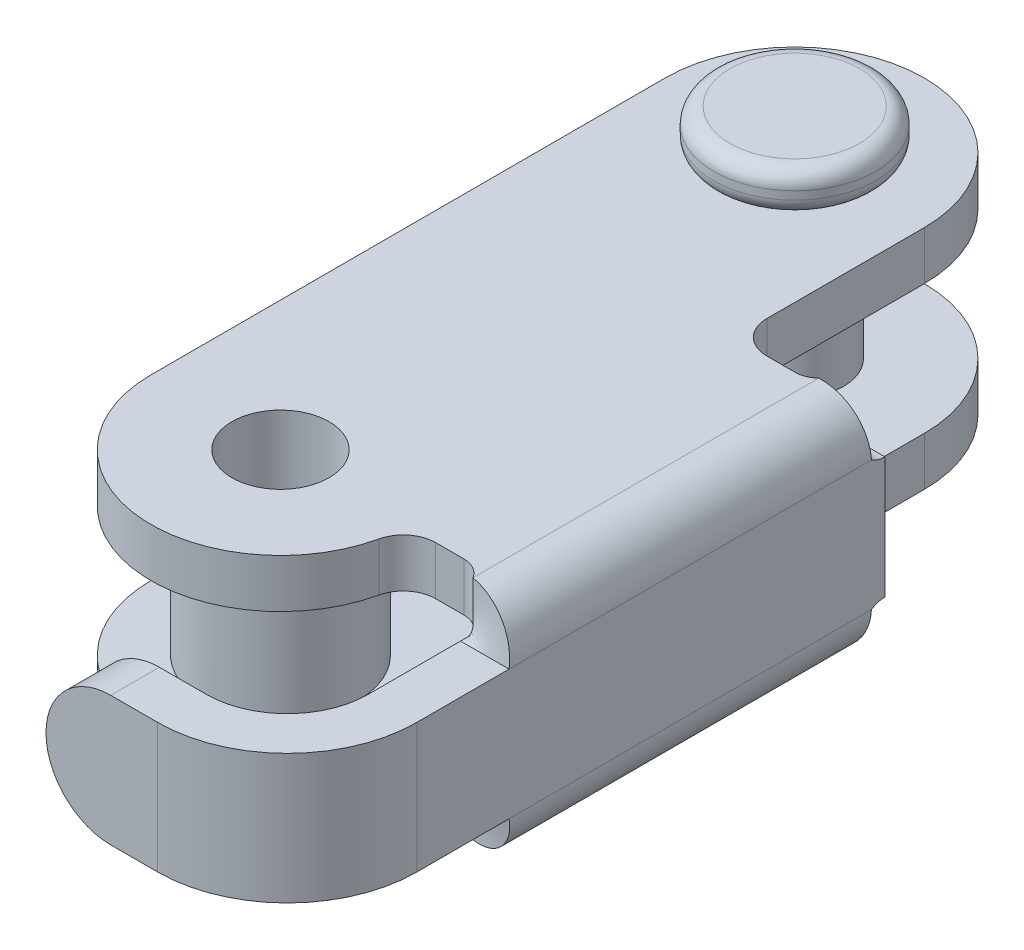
ISO-10303-21;
HEADER;
FILE_DESCRIPTION(('STEP AP214'),'2;1');
FILE_NAME('part.step','',(''),(''),'','','');
FILE_SCHEMA(('AUTOMOTIVE_DESIGN { 1 0 10303 214 1 1 1 1 }'));
ENDSEC;
DATA;
#1=APPLICATION_CONTEXT('core data for automotive mechanical design processes');
#2=APPLICATION_PROTOCOL_DEFINITION('international standard','automotive_design',2000,#1);
#3=PRODUCT_CONTEXT('',#1,'mechanical');
#4=PRODUCT('Part','Part','',(#3));
#5=PRODUCT_RELATED_PRODUCT_CATEGORY('part','',(#4));
#6=PRODUCT_DEFINITION_FORMATION('','',#4);
#7=PRODUCT_DEFINITION_CONTEXT('part definition',#1,'design');
#8=PRODUCT_DEFINITION('design','',#6,#7);
#9=PRODUCT_DEFINITION_SHAPE('','',#8);
#10=(LENGTH_UNIT() NAMED_UNIT(*) SI_UNIT(.MILLI.,.METRE.));
#11=(NAMED_UNIT(*) PLANE_ANGLE_UNIT() SI_UNIT($,.RADIAN.));
#12=(NAMED_UNIT(*) SI_UNIT($,.STERADIAN.) SOLID_ANGLE_UNIT());
#13=UNCERTAINTY_MEASURE_WITH_UNIT(LENGTH_MEASURE(1.E-05),#10,'distance_accuracy_value','');
#14=(GEOMETRIC_REPRESENTATION_CONTEXT(3) GLOBAL_UNCERTAINTY_ASSIGNED_CONTEXT((#13)) GLOBAL_UNIT_ASSIGNED_CONTEXT((#10,
#11,#12)) REPRESENTATION_CONTEXT('',''));
#15=CARTESIAN_POINT('',(0.,0.,0.));
#16=DIRECTION('',(0.,0.,1.));
#17=DIRECTION('',(1.,0.,0.));
#18=AXIS2_PLACEMENT_3D('',#15,#16,#17);
#19=CARTESIAN_POINT('',(-3.05311331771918E-13,-9.50000000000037,0.));
#20=DIRECTION('',(0.,1.,0.));
#21=DIRECTION('',(0.994794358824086,0.,0.101902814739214));
#22=AXIS2_PLACEMENT_3D('',#19,#20,#21);
#23=PLANE('',#22);
#24=CARTESIAN_POINT('',(-3.05311331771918E-13,-9.50000000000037,0.));
#25=DIRECTION('',(0.,1.,0.));
#26=DIRECTION('',(0.994794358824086,0.,0.101902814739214));
#27=AXIS2_PLACEMENT_3D('',#24,#25,#26);
#28=CIRCLE('',#27,4.);
#29=CARTESIAN_POINT('',(3.97917743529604,-9.5000000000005,0.407611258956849));
#30=VERTEX_POINT('',#29);
#31=EDGE_CURVE('E1305',#30,#30,#28,.F.);
#32=ORIENTED_EDGE('',*,*,#31,.T.);
#33=EDGE_LOOP('',(#32));
#34=FACE_BOUND('',#33,.T.);
#35=ADVANCED_FACE('F14',(#34),#23,.F.);
#36=CARTESIAN_POINT('',(-2.70616862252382E-13,-8.50000000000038,0.));
#37=DIRECTION('',(0.,1.,0.));
#38=DIRECTION('',(0.994794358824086,0.,0.101902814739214));
#39=AXIS2_PLACEMENT_3D('',#36,#37,#38);
#40=TOROIDAL_SURFACE('',#39,4.,1.);
#41=ORIENTED_EDGE('',*,*,#31,.F.);
#42=EDGE_LOOP('',(#41));
#43=FACE_BOUND('',#42,.T.);
#44=CARTESIAN_POINT('',(-2.70616862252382E-13,-8.50000000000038,0.));
#45=DIRECTION('',(0.,1.,0.));
#46=DIRECTION('',(0.994794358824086,0.,0.101902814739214));
#47=AXIS2_PLACEMENT_3D('',#44,#45,#46);
#48=CIRCLE('',#47,5.);
#49=CARTESIAN_POINT('',(4.97397179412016,-8.50000000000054,0.509514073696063));
#50=VERTEX_POINT('',#49);
#51=EDGE_CURVE('E1307',#50,#50,#48,.T.);
#52=ORIENTED_EDGE('',*,*,#51,.F.);
#53=EDGE_LOOP('',(#52));
#54=FACE_BOUND('',#53,.T.);
#55=ADVANCED_FACE('F767',(#43,#54),#40,.T.);
#56=CARTESIAN_POINT('',(-2.22044604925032E-13,-7.00000000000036,0.));
#57=DIRECTION('',(0.,-1.,0.));
#58=DIRECTION('',(-0.994794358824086,0.,-0.101902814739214));
#59=AXIS2_PLACEMENT_3D('',#56,#57,#58);
#60=CYLINDRICAL_SURFACE('',#59,5.);
#61=ORIENTED_EDGE('',*,*,#51,.T.);
#62=EDGE_LOOP('',(#61));
#63=FACE_BOUND('',#62,.T.);
#64=CARTESIAN_POINT('',(-2.56739074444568E-13,-8.00000000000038,0.));
#65=DIRECTION('',(0.,1.,0.));
#66=DIRECTION('',(0.994794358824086,0.,0.101902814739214));
#67=AXIS2_PLACEMENT_3D('',#64,#65,#66);
#68=CIRCLE('',#67,5.);
#69=CARTESIAN_POINT('',(4.97397179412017,-8.00000000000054,0.509514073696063));
#70=VERTEX_POINT('',#69);
#71=EDGE_CURVE('E832',#70,#70,#68,.F.);
#72=ORIENTED_EDGE('',*,*,#71,.T.);
#73=EDGE_LOOP('',(#72));
#74=FACE_BOUND('',#73,.T.);
#75=ADVANCED_FACE('F763',(#63,#74),#60,.T.);
#76=CARTESIAN_POINT('',(-2.56739074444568E-13,-8.00000000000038,0.));
#77=DIRECTION('',(0.,1.,0.));
#78=DIRECTION('',(0.994794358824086,0.,0.101902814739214));
#79=AXIS2_PLACEMENT_3D('',#76,#77,#78);
#80=TOROIDAL_SURFACE('',#79,4.,1.);
#81=ORIENTED_EDGE('',*,*,#71,.F.);
#82=EDGE_LOOP('',(#81));
#83=FACE_BOUND('',#82,.T.);
#84=CARTESIAN_POINT('',(-2.22044604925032E-13,-7.00000000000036,0.));
#85=DIRECTION('',(0.,1.,0.));
#86=DIRECTION('',(0.994794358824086,0.,0.101902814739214));
#87=AXIS2_PLACEMENT_3D('',#84,#85,#86);
#88=CIRCLE('',#87,4.);
#89=CARTESIAN_POINT('',(3.97917743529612,-7.00000000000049,0.407611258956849));
#90=VERTEX_POINT('',#89);
#91=EDGE_CURVE('E815',#90,#90,#88,.T.);
#92=ORIENTED_EDGE('',*,*,#91,.F.);
#93=EDGE_LOOP('',(#92));
#94=FACE_BOUND('',#93,.T.);
#95=ADVANCED_FACE('F766',(#83,#94),#80,.T.);
#96=CARTESIAN_POINT('',(3.12250225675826E-13,9.49999999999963,0.));
#97=DIRECTION('',(0.,-1.,0.));
#98=DIRECTION('',(0.994794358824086,0.,0.101902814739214));
#99=AXIS2_PLACEMENT_3D('',#96,#97,#98);
#100=PLANE('',#99);
#101=CARTESIAN_POINT('',(3.12250225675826E-13,9.49999999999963,0.));
#102=DIRECTION('',(0.,-1.,0.));
#103=DIRECTION('',(-0.994794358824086,0.,-0.101902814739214));
#104=AXIS2_PLACEMENT_3D('',#101,#102,#103);
#105=CIRCLE('',#104,4.);
#106=CARTESIAN_POINT('',(-3.97917743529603,9.49999999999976,-0.407611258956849));
#107=VERTEX_POINT('',#106);
#108=EDGE_CURVE('E810',#107,#107,#105,.F.);
#109=ORIENTED_EDGE('',*,*,#108,.T.);
#110=EDGE_LOOP('',(#109));
#111=FACE_BOUND('',#110,.T.);
#112=ADVANCED_FACE('F783',(#111),#100,.F.);
#113=CARTESIAN_POINT('',(2.77555756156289E-13,8.49999999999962,0.));
#114=DIRECTION('',(0.,-1.,0.));
#115=DIRECTION('',(-0.994794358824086,0.,-0.101902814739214));
#116=AXIS2_PLACEMENT_3D('',#113,#114,#115);
#117=TOROIDAL_SURFACE('',#116,4.,1.);
#118=CARTESIAN_POINT('',(2.77555756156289E-13,8.49999999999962,0.));
#119=DIRECTION('',(0.,-1.,0.));
#120=DIRECTION('',(-0.994794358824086,0.,-0.101902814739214));
#121=AXIS2_PLACEMENT_3D('',#118,#119,#120);
#122=CIRCLE('',#121,5.);
#123=CARTESIAN_POINT('',(-4.97397179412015,8.49999999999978,-0.509514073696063));
#124=VERTEX_POINT('',#123);
#125=EDGE_CURVE('E809',#124,#124,#122,.T.);
#126=ORIENTED_EDGE('',*,*,#125,.F.);
#127=EDGE_LOOP('',(#126));
#128=FACE_BOUND('',#127,.T.);
#129=ORIENTED_EDGE('',*,*,#108,.F.);
#130=EDGE_LOOP('',(#129));
#131=FACE_BOUND('',#130,.T.);
#132=ADVANCED_FACE('F788',(#128,#131),#117,.T.);
#133=CARTESIAN_POINT('',(2.28983498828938E-13,6.99999999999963,0.));
#134=DIRECTION('',(0.,1.,0.));
#135=DIRECTION('',(0.994794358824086,0.,0.101902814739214));
#136=AXIS2_PLACEMENT_3D('',#133,#134,#135);
#137=CYLINDRICAL_SURFACE('',#136,5.);
#138=ORIENTED_EDGE('',*,*,#125,.T.);
#139=EDGE_LOOP('',(#138));
#140=FACE_BOUND('',#139,.T.);
#141=CARTESIAN_POINT('',(2.63677968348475E-13,7.99999999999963,0.));
#142=DIRECTION('',(0.,-1.,0.));
#143=DIRECTION('',(-0.994794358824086,0.,-0.101902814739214));
#144=AXIS2_PLACEMENT_3D('',#141,#142,#143);
#145=CIRCLE('',#144,5.);
#146=CARTESIAN_POINT('',(-4.97397179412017,7.99999999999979,-0.509514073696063));
#147=VERTEX_POINT('',#146);
#148=EDGE_CURVE('E807',#147,#147,#145,.F.);
#149=ORIENTED_EDGE('',*,*,#148,.T.);
#150=EDGE_LOOP('',(#149));
#151=FACE_BOUND('',#150,.T.);
#152=ADVANCED_FACE('F785',(#140,#151),#137,.T.);
#153=CARTESIAN_POINT('',(2.63677968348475E-13,7.99999999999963,0.));
#154=DIRECTION('',(0.,-1.,0.));
#155=DIRECTION('',(-0.994794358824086,0.,-0.101902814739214));
#156=AXIS2_PLACEMENT_3D('',#153,#154,#155);
#157=TOROIDAL_SURFACE('',#156,4.,1.);
#158=CARTESIAN_POINT('',(2.28983498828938E-13,6.99999999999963,0.));
#159=DIRECTION('',(0.,-1.,0.));
#160=DIRECTION('',(-0.994794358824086,0.,-0.101902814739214));
#161=AXIS2_PLACEMENT_3D('',#158,#159,#160);
#162=CIRCLE('',#161,4.);
#163=CARTESIAN_POINT('',(-3.97917743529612,6.99999999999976,-0.407611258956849));
#164=VERTEX_POINT('',#163);
#165=EDGE_CURVE('E804',#164,#164,#162,.T.);
#166=ORIENTED_EDGE('',*,*,#165,.F.);
#167=EDGE_LOOP('',(#166));
#168=FACE_BOUND('',#167,.T.);
#169=ORIENTED_EDGE('',*,*,#148,.F.);
#170=EDGE_LOOP('',(#169));
#171=FACE_BOUND('',#170,.T.);
#172=ADVANCED_FACE('F772',(#168,#171),#157,.T.);
#173=CARTESIAN_POINT('',(2.28983498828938E-13,6.99999999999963,0.));
#174=DIRECTION('',(0.,-1.,0.));
#175=DIRECTION('',(-0.994794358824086,0.,-0.101902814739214));
#176=AXIS2_PLACEMENT_3D('',#173,#174,#175);
#177=CYLINDRICAL_SURFACE('',#176,3.);
#178=CARTESIAN_POINT('',(-1.2490009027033E-13,-4.,0.));
#179=DIRECTION('',(0.,1.,0.));
#180=DIRECTION('',(0.0781234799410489,0.,-0.996943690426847));
#181=AXIS2_PLACEMENT_3D('',#178,#179,#180);
#182=CIRCLE('',#181,3.);
#183=CARTESIAN_POINT('',(0.234370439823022,-4.00000000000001,-2.99083107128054));
#184=VERTEX_POINT('',#183);
#185=EDGE_CURVE('E9',#184,#184,#182,.T.);
#186=ORIENTED_EDGE('',*,*,#185,.T.);
#187=EDGE_LOOP('',(#186));
#188=FACE_BOUND('',#187,.T.);
#189=CARTESIAN_POINT('',(1.31838984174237E-13,3.99999999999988,0.));
#190=DIRECTION('',(0.,-1.,0.));
#191=DIRECTION('',(0.996943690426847,0.,0.0781234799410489));
#192=AXIS2_PLACEMENT_3D('',#189,#190,#191);
#193=CIRCLE('',#192,3.);
#194=CARTESIAN_POINT('',(2.99083107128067,3.9999999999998,0.234370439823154));
#195=VERTEX_POINT('',#194);
#196=EDGE_CURVE('E23',#195,#195,#193,.T.);
#197=ORIENTED_EDGE('',*,*,#196,.T.);
#198=EDGE_LOOP('',(#197));
#199=FACE_BOUND('',#198,.T.);
#200=ADVANCED_FACE('F773',(#188,#199),#177,.T.);
#201=CARTESIAN_POINT('',(23.6950880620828,3.99999999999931,44.1209119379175));
#202=DIRECTION('',(0.,-1.,0.));
#203=DIRECTION('',(-1.,0.,0.));
#204=AXIS2_PLACEMENT_3D('',#201,#202,#203);
#205=PLANE('',#204);
#206=DIRECTION('',(1.,0.,0.));
#207=VECTOR('',#206,1.);
#208=CARTESIAN_POINT('',(23.6950880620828,3.99999999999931,47.1209119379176));
#209=LINE('',#208,#207);
#210=CARTESIAN_POINT('',(4.89508806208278,3.99999999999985,47.1209119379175));
#211=VERTEX_POINT('',#210);
#212=CARTESIAN_POINT('',(7.78999999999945,3.99999999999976,47.1209119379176));
#213=VERTEX_POINT('',#212);
#214=EDGE_CURVE('E410',#211,#213,#209,.T.);
#215=ORIENTED_EDGE('',*,*,#214,.T.);
#216=CARTESIAN_POINT('',(7.78999999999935,3.99999999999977,39.1209119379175));
#217=DIRECTION('',(0.,1.,0.));
#218=DIRECTION('',(-1.,0.,0.));
#219=AXIS2_PLACEMENT_3D('',#216,#217,#218);
#220=CIRCLE('',#219,8.);
#221=CARTESIAN_POINT('',(15.7899999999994,3.99999999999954,39.1209119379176));
#222=VERTEX_POINT('',#221);
#223=EDGE_CURVE('E373',#213,#222,#220,.T.);
#224=ORIENTED_EDGE('',*,*,#223,.T.);
#225=DIRECTION('',(0.,0.,-1.));
#226=VECTOR('',#225,1.);
#227=CARTESIAN_POINT('',(15.7899999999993,3.99999999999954,33.426000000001));
#228=LINE('',#227,#226);
#229=CARTESIAN_POINT('',(15.7899999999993,3.99999999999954,33.426000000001));
#230=VERTEX_POINT('',#229);
#231=EDGE_CURVE('E457',#222,#230,#228,.T.);
#232=ORIENTED_EDGE('',*,*,#231,.T.);
#233=DIRECTION('',(1.,0.,0.));
#234=VECTOR('',#233,1.);
#235=CARTESIAN_POINT('',(12.7899999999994,3.99999999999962,33.4260000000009));
#236=LINE('',#235,#234);
#237=CARTESIAN_POINT('',(12.7899999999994,3.99999999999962,33.4260000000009));
#238=VERTEX_POINT('',#237);
#239=EDGE_CURVE('E434',#238,#230,#236,.T.);
#240=ORIENTED_EDGE('',*,*,#239,.F.);
#241=DIRECTION('',(0.,0.,-1.));
#242=VECTOR('',#241,1.);
#243=CARTESIAN_POINT('',(12.7899999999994,3.99999999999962,33.4260000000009));
#244=LINE('',#243,#242);
#245=CARTESIAN_POINT('',(12.7899999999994,3.99999999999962,39.1209119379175));
#246=VERTEX_POINT('',#245);
#247=EDGE_CURVE('E390',#246,#238,#244,.T.);
#248=ORIENTED_EDGE('',*,*,#247,.F.);
#249=CARTESIAN_POINT('',(7.78999999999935,3.99999999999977,39.1209119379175));
#250=DIRECTION('',(0.,1.,0.));
#251=DIRECTION('',(-1.,0.,0.));
#252=AXIS2_PLACEMENT_3D('',#249,#250,#251);
#253=CIRCLE('',#252,5.);
#254=CARTESIAN_POINT('',(7.7899999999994,3.99999999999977,44.1209119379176));
#255=VERTEX_POINT('',#254);
#256=EDGE_CURVE('E372',#255,#246,#253,.T.);
#257=ORIENTED_EDGE('',*,*,#256,.F.);
#258=DIRECTION('',(1.,0.,0.));
#259=VECTOR('',#258,1.);
#260=CARTESIAN_POINT('',(23.6950880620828,3.99999999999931,44.1209119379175));
#261=LINE('',#260,#259);
#262=CARTESIAN_POINT('',(4.89508806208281,3.99999999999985,44.1209119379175));
#263=VERTEX_POINT('',#262);
#264=EDGE_CURVE('E406',#263,#255,#261,.T.);
#265=ORIENTED_EDGE('',*,*,#264,.F.);
#266=DIRECTION('',(0.,0.,1.));
#267=VECTOR('',#266,1.);
#268=CARTESIAN_POINT('',(4.89508806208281,3.99999999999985,44.1209119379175));
#269=LINE('',#268,#267);
#270=EDGE_CURVE('E412',#263,#211,#269,.T.);
#271=ORIENTED_EDGE('',*,*,#270,.T.);
#272=EDGE_LOOP('',(#215,#224,#232,#240,#248,#257,#265,#271));
#273=FACE_BOUND('',#272,.T.);
#274=ADVANCED_FACE('F776',(#273),#205,.F.);
#275=CARTESIAN_POINT('',(4.89508806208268,-1.48318857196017E-13,44.1209119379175));
#276=DIRECTION('',(0.,0.,1.));
#277=DIRECTION('',(0.,1.,0.));
#278=AXIS2_PLACEMENT_3D('',#275,#276,#277);
#279=CYLINDRICAL_SURFACE('',#278,4.);
#280=CARTESIAN_POINT('',(4.89508806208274,-1.50053580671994E-13,47.1209119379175));
#281=DIRECTION('',(0.,0.,-1.));
#282=DIRECTION('',(0.,-1.,0.));
#283=AXIS2_PLACEMENT_3D('',#280,#281,#282);
#284=CIRCLE('',#283,4.);
#285=CARTESIAN_POINT('',(4.89508806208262,-4.00000000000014,47.1209119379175));
#286=VERTEX_POINT('',#285);
#287=EDGE_CURVE('E408',#286,#211,#284,.T.);
#288=ORIENTED_EDGE('',*,*,#287,.T.);
#289=ORIENTED_EDGE('',*,*,#270,.F.);
#290=CARTESIAN_POINT('',(4.89508806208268,-1.48318857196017E-13,44.1209119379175));
#291=DIRECTION('',(0.,0.,-1.));
#292=DIRECTION('',(0.,-1.,0.));
#293=AXIS2_PLACEMENT_3D('',#290,#291,#292);
#294=CIRCLE('',#293,4.);
#295=CARTESIAN_POINT('',(4.89508806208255,-4.00000000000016,44.1209119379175));
#296=VERTEX_POINT('',#295);
#297=EDGE_CURVE('E404',#296,#263,#294,.T.);
#298=ORIENTED_EDGE('',*,*,#297,.F.);
#299=DIRECTION('',(0.,0.,1.));
#300=VECTOR('',#299,1.);
#301=CARTESIAN_POINT('',(4.89508806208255,-4.00000000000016,44.1209119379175));
#302=LINE('',#301,#300);
#303=EDGE_CURVE('E415',#296,#286,#302,.T.);
#304=ORIENTED_EDGE('',*,*,#303,.T.);
#305=EDGE_LOOP('',(#288,#289,#298,#304));
#306=FACE_BOUND('',#305,.T.);
#307=ADVANCED_FACE('F930',(#306),#279,.T.);
#308=CARTESIAN_POINT('',(23.6950880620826,-4.00000000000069,44.1209119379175));
#309=DIRECTION('',(0.,1.,0.));
#310=DIRECTION('',(0.,0.,-1.));
#311=AXIS2_PLACEMENT_3D('',#308,#309,#310);
#312=PLANE('',#311);
#313=DIRECTION('',(-1.,0.,0.));
#314=VECTOR('',#313,1.);
#315=CARTESIAN_POINT('',(23.6950880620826,-4.00000000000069,44.1209119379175));
#316=LINE('',#315,#314);
#317=CARTESIAN_POINT('',(7.78999999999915,-4.00000000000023,44.1209119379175));
#318=VERTEX_POINT('',#317);
#319=EDGE_CURVE('E407',#318,#296,#316,.T.);
#320=ORIENTED_EDGE('',*,*,#319,.F.);
#321=CARTESIAN_POINT('',(7.7899999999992,-4.00000000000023,39.1209119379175));
#322=DIRECTION('',(0.,-1.,0.));
#323=DIRECTION('',(1.,0.,0.));
#324=AXIS2_PLACEMENT_3D('',#321,#322,#323);
#325=CIRCLE('',#324,5.);
#326=CARTESIAN_POINT('',(12.7899999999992,-4.00000000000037,39.1209119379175));
#327=VERTEX_POINT('',#326);
#328=EDGE_CURVE('E369',#327,#318,#325,.T.);
#329=ORIENTED_EDGE('',*,*,#328,.F.);
#330=DIRECTION('',(0.,0.,1.));
#331=VECTOR('',#330,1.);
#332=CARTESIAN_POINT('',(12.7899999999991,-4.00000000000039,33.4260000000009));
#333=LINE('',#332,#331);
#334=CARTESIAN_POINT('',(12.7899999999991,-4.00000000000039,33.4260000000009));
#335=VERTEX_POINT('',#334);
#336=EDGE_CURVE('E391',#335,#327,#333,.T.);
#337=ORIENTED_EDGE('',*,*,#336,.F.);
#338=DIRECTION('',(1.,0.,0.));
#339=VECTOR('',#338,1.);
#340=CARTESIAN_POINT('',(12.7899999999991,-4.00000000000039,33.4260000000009));
#341=LINE('',#340,#339);
#342=CARTESIAN_POINT('',(15.7899999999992,-4.00000000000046,33.426000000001));
#343=VERTEX_POINT('',#342);
#344=EDGE_CURVE('E500',#335,#343,#341,.T.);
#345=ORIENTED_EDGE('',*,*,#344,.T.);
#346=DIRECTION('',(0.,0.,1.));
#347=VECTOR('',#346,1.);
#348=CARTESIAN_POINT('',(15.7899999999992,-4.00000000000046,33.426000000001));
#349=LINE('',#348,#347);
#350=CARTESIAN_POINT('',(15.7899999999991,-4.00000000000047,39.1209119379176));
#351=VERTEX_POINT('',#350);
#352=EDGE_CURVE('E426',#343,#351,#349,.T.);
#353=ORIENTED_EDGE('',*,*,#352,.T.);
#354=CARTESIAN_POINT('',(7.7899999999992,-4.00000000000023,39.1209119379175));
#355=DIRECTION('',(0.,1.,0.));
#356=DIRECTION('',(-1.,0.,0.));
#357=AXIS2_PLACEMENT_3D('',#354,#355,#356);
#358=CIRCLE('',#357,8.);
#359=CARTESIAN_POINT('',(7.78999999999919,-4.00000000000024,47.1209119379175));
#360=VERTEX_POINT('',#359);
#361=EDGE_CURVE('E377',#351,#360,#358,.F.);
#362=ORIENTED_EDGE('',*,*,#361,.T.);
#363=DIRECTION('',(-1.,0.,0.));
#364=VECTOR('',#363,1.);
#365=CARTESIAN_POINT('',(23.6950880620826,-4.00000000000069,47.1209119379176));
#366=LINE('',#365,#364);
#367=EDGE_CURVE('E411',#360,#286,#366,.T.);
#368=ORIENTED_EDGE('',*,*,#367,.T.);
#369=ORIENTED_EDGE('',*,*,#303,.F.);
#370=EDGE_LOOP('',(#320,#329,#337,#345,#353,#362,#368,#369));
#371=FACE_BOUND('',#370,.T.);
#372=ADVANCED_FACE('F914',(#371),#312,.F.);
#373=CARTESIAN_POINT('',(23.1950880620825,-7.23961967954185,47.1209119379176));
#374=DIRECTION('',(0.,0.,-1.));
#375=DIRECTION('',(0.,-1.,0.));
#376=AXIS2_PLACEMENT_3D('',#373,#374,#375);
#377=PLANE('',#376);
#378=ORIENTED_EDGE('',*,*,#367,.F.);
#379=DIRECTION('',(0.,1.,0.));
#380=VECTOR('',#379,1.);
#381=CARTESIAN_POINT('',(7.78999999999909,-7.23961967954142,47.1209119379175));
#382=LINE('',#381,#380);
#383=EDGE_CURVE('E421',#360,#213,#382,.T.);
#384=ORIENTED_EDGE('',*,*,#383,.T.);
#385=ORIENTED_EDGE('',*,*,#214,.F.);
#386=ORIENTED_EDGE('',*,*,#287,.F.);
#387=EDGE_LOOP('',(#378,#384,#385,#386));
#388=FACE_BOUND('',#387,.T.);
#389=ADVANCED_FACE('F757',(#388),#377,.F.);
#390=CARTESIAN_POINT('',(23.1950880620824,-7.23961967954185,44.1209119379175));
#391=DIRECTION('',(0.,0.,-1.));
#392=DIRECTION('',(0.,-1.,0.));
#393=AXIS2_PLACEMENT_3D('',#390,#391,#392);
#394=PLANE('',#393);
#395=DIRECTION('',(0.,1.,0.));
#396=VECTOR('',#395,1.);
#397=CARTESIAN_POINT('',(7.78999999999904,-7.23961967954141,44.1209119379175));
#398=LINE('',#397,#396);
#399=EDGE_CURVE('E418',#318,#255,#398,.T.);
#400=ORIENTED_EDGE('',*,*,#399,.F.);
#401=ORIENTED_EDGE('',*,*,#319,.T.);
#402=ORIENTED_EDGE('',*,*,#297,.T.);
#403=ORIENTED_EDGE('',*,*,#264,.T.);
#404=EDGE_LOOP('',(#400,#401,#402,#403));
#405=FACE_BOUND('',#404,.T.);
#406=ADVANCED_FACE('F747',(#405),#394,.T.);
#407=CARTESIAN_POINT('',(5.68989300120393E-13,-7.00000000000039,31.75));
#408=DIRECTION('',(0.,1.,0.));
#409=DIRECTION('',(0.485354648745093,0.,0.874317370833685));
#410=AXIS2_PLACEMENT_3D('',#407,#408,#409);
#411=CYLINDRICAL_SURFACE('',#410,3.);
#412=CARTESIAN_POINT('',(1.02001740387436E-12,6.9999999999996,31.75));
#413=DIRECTION('',(0.,-1.,0.));
#414=DIRECTION('',(-0.485354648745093,0.,-0.874317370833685));
#415=AXIS2_PLACEMENT_3D('',#412,#413,#414);
#416=CIRCLE('',#415,3.);
#417=CARTESIAN_POINT('',(-1.45606394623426,6.99999999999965,29.1270478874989));
#418=VERTEX_POINT('',#417);
#419=EDGE_CURVE('E824',#418,#418,#416,.F.);
#420=ORIENTED_EDGE('',*,*,#419,.T.);
#421=EDGE_LOOP('',(#420));
#422=FACE_BOUND('',#421,.T.);
#423=CARTESIAN_POINT('',(5.68989300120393E-13,-7.00000000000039,31.75));
#424=DIRECTION('',(0.,-1.,0.));
#425=DIRECTION('',(-0.485354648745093,0.,-0.874317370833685));
#426=AXIS2_PLACEMENT_3D('',#423,#424,#425);
#427=CIRCLE('',#426,3.);
#428=CARTESIAN_POINT('',(-1.45606394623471,-7.00000000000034,29.1270478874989));
#429=VERTEX_POINT('',#428);
#430=EDGE_CURVE('E508',#429,#429,#427,.T.);
#431=ORIENTED_EDGE('',*,*,#430,.T.);
#432=EDGE_LOOP('',(#431));
#433=FACE_BOUND('',#432,.T.);
#434=ADVANCED_FACE('F730',(#422,#433),#411,.F.);
#435=CARTESIAN_POINT('',(7.78999999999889,-13.3134404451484,39.1209119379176));
#436=DIRECTION('',(0.,1.,0.));
#437=DIRECTION('',(-1.,0.,0.));
#438=AXIS2_PLACEMENT_3D('',#435,#436,#437);
#439=CYLINDRICAL_SURFACE('',#438,8.);
#440=ORIENTED_EDGE('',*,*,#383,.F.);
#441=ORIENTED_EDGE('',*,*,#361,.F.);
#442=DIRECTION('',(0.,1.,0.));
#443=VECTOR('',#442,1.);
#444=CARTESIAN_POINT('',(15.7899999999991,-7.23961967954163,39.1209119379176));
#445=LINE('',#444,#443);
#446=EDGE_CURVE('E376',#351,#222,#445,.T.);
#447=ORIENTED_EDGE('',*,*,#446,.T.);
#448=ORIENTED_EDGE('',*,*,#223,.F.);
#449=EDGE_LOOP('',(#440,#441,#447,#448));
#450=FACE_BOUND('',#449,.T.);
#451=ADVANCED_FACE('F746',(#450),#439,.T.);
#452=CARTESIAN_POINT('',(12.7899999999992,-3.75000000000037,10.226000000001));
#453=DIRECTION('',(0.,0.,1.));
#454=DIRECTION('',(-1.,0.,0.));
#455=AXIS2_PLACEMENT_3D('',#452,#453,#454);
#456=PLANE('',#455);
#457=DIRECTION('',(0.,-1.,0.));
#458=VECTOR('',#457,1.);
#459=CARTESIAN_POINT('',(15.7899999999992,-3.75000000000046,10.226000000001));
#460=LINE('',#459,#458);
#461=CARTESIAN_POINT('',(15.7899999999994,3.74999999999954,10.226000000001));
#462=VERTEX_POINT('',#461);
#463=CARTESIAN_POINT('',(15.7899999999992,-3.75000000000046,10.226000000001));
#464=VERTEX_POINT('',#463);
#465=EDGE_CURVE('E396',#462,#464,#460,.T.);
#466=ORIENTED_EDGE('',*,*,#465,.T.);
#467=DIRECTION('',(1.,0.,0.));
#468=VECTOR('',#467,1.);
#469=CARTESIAN_POINT('',(12.7899999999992,-3.75000000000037,10.226000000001));
#470=LINE('',#469,#468);
#471=CARTESIAN_POINT('',(12.7899999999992,-3.75000000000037,10.226000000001));
#472=VERTEX_POINT('',#471);
#473=EDGE_CURVE('E398',#472,#464,#470,.T.);
#474=ORIENTED_EDGE('',*,*,#473,.F.);
#475=DIRECTION('',(0.,-1.,0.));
#476=VECTOR('',#475,1.);
#477=CARTESIAN_POINT('',(12.7899999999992,-3.75000000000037,10.226000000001));
#478=LINE('',#477,#476);
#479=CARTESIAN_POINT('',(12.7899999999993,3.74999999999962,10.226000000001));
#480=VERTEX_POINT('',#479);
#481=EDGE_CURVE('E383',#480,#472,#478,.T.);
#482=ORIENTED_EDGE('',*,*,#481,.F.);
#483=DIRECTION('',(1.,0.,0.));
#484=VECTOR('',#483,1.);
#485=CARTESIAN_POINT('',(12.7899999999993,3.74999999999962,10.226000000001));
#486=LINE('',#485,#484);
#487=EDGE_CURVE('E392',#480,#462,#486,.T.);
#488=ORIENTED_EDGE('',*,*,#487,.T.);
#489=EDGE_LOOP('',(#466,#474,#482,#488));
#490=FACE_BOUND('',#489,.T.);
#491=ADVANCED_FACE('F754',(#490),#456,.F.);
#492=CARTESIAN_POINT('',(12.7899999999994,5.24999999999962,10.226000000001));
#493=DIRECTION('',(1.,0.,0.));
#494=DIRECTION('',(0.,1.,0.));
#495=AXIS2_PLACEMENT_3D('',#492,#493,#494);
#496=CYLINDRICAL_SURFACE('',#495,1.5);
#497=CARTESIAN_POINT('',(12.7899999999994,5.24999999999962,10.226000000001));
#498=DIRECTION('',(1.,0.,0.));
#499=DIRECTION('',(0.,-1.,0.));
#500=AXIS2_PLACEMENT_3D('',#497,#498,#499);
#501=CIRCLE('',#500,1.5);
#502=CARTESIAN_POINT('',(12.7899999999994,3.99999999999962,11.0551561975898));
#503=VERTEX_POINT('',#502);
#504=EDGE_CURVE('E386',#503,#480,#501,.T.);
#505=ORIENTED_EDGE('',*,*,#504,.F.);
#506=DIRECTION('',(1.,0.,0.));
#507=VECTOR('',#506,1.);
#508=CARTESIAN_POINT('',(12.7899999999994,3.99999999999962,11.0551561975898));
#509=LINE('',#508,#507);
#510=CARTESIAN_POINT('',(15.7899999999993,3.99999999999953,11.0551561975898));
#511=VERTEX_POINT('',#510);
#512=EDGE_CURVE('E436',#503,#511,#509,.T.);
#513=ORIENTED_EDGE('',*,*,#512,.T.);
#514=CARTESIAN_POINT('',(15.7899999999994,5.24999999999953,10.226000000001));
#515=DIRECTION('',(1.,0.,0.));
#516=DIRECTION('',(0.,-1.,0.));
#517=AXIS2_PLACEMENT_3D('',#514,#515,#516);
#518=CIRCLE('',#517,1.5);
#519=EDGE_CURVE('E395',#511,#462,#518,.T.);
#520=ORIENTED_EDGE('',*,*,#519,.T.);
#521=ORIENTED_EDGE('',*,*,#487,.F.);
#522=EDGE_LOOP('',(#505,#513,#520,#521));
#523=FACE_BOUND('',#522,.T.);
#524=ADVANCED_FACE('F689',(#523),#496,.F.);
#525=CARTESIAN_POINT('',(7.78999999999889,-13.3134404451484,39.1209119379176));
#526=DIRECTION('',(0.,1.,0.));
#527=DIRECTION('',(-1.,0.,0.));
#528=AXIS2_PLACEMENT_3D('',#525,#526,#527);
#529=CYLINDRICAL_SURFACE('',#528,5.);
#530=ORIENTED_EDGE('',*,*,#399,.T.);
#531=ORIENTED_EDGE('',*,*,#256,.T.);
#532=DIRECTION('',(0.,1.,0.));
#533=VECTOR('',#532,1.);
#534=CARTESIAN_POINT('',(12.789999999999,-7.23961967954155,39.1209119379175));
#535=LINE('',#534,#533);
#536=EDGE_CURVE('E387',#327,#246,#535,.T.);
#537=ORIENTED_EDGE('',*,*,#536,.F.);
#538=ORIENTED_EDGE('',*,*,#328,.T.);
#539=EDGE_LOOP('',(#530,#531,#537,#538));
#540=FACE_BOUND('',#539,.T.);
#541=ADVANCED_FACE('F918',(#540),#529,.F.);
#542=CARTESIAN_POINT('',(12.7899999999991,-5.25000000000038,10.226000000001));
#543=DIRECTION('',(1.,0.,0.));
#544=DIRECTION('',(0.,1.,0.));
#545=AXIS2_PLACEMENT_3D('',#542,#543,#544);
#546=CYLINDRICAL_SURFACE('',#545,1.5);
#547=DIRECTION('',(1.,0.,0.));
#548=VECTOR('',#547,1.);
#549=CARTESIAN_POINT('',(12.7899999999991,-4.00000000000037,11.0551561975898));
#550=LINE('',#549,#548);
#551=CARTESIAN_POINT('',(12.7899999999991,-4.00000000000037,11.0551561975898));
#552=VERTEX_POINT('',#551);
#553=CARTESIAN_POINT('',(15.7899999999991,-4.00000000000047,11.0551561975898));
#554=VERTEX_POINT('',#553);
#555=EDGE_CURVE('E498',#552,#554,#550,.T.);
#556=ORIENTED_EDGE('',*,*,#555,.F.);
#557=CARTESIAN_POINT('',(12.7899999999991,-5.25000000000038,10.226000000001));
#558=DIRECTION('',(1.,0.,0.));
#559=DIRECTION('',(0.,-1.,0.));
#560=AXIS2_PLACEMENT_3D('',#557,#558,#559);
#561=CIRCLE('',#560,1.5);
#562=EDGE_CURVE('E385',#472,#552,#561,.T.);
#563=ORIENTED_EDGE('',*,*,#562,.F.);
#564=ORIENTED_EDGE('',*,*,#473,.T.);
#565=CARTESIAN_POINT('',(15.7899999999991,-5.25000000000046,10.226000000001));
#566=DIRECTION('',(1.,0.,0.));
#567=DIRECTION('',(0.,-1.,0.));
#568=AXIS2_PLACEMENT_3D('',#565,#566,#567);
#569=CIRCLE('',#568,1.5);
#570=EDGE_CURVE('E401',#464,#554,#569,.T.);
#571=ORIENTED_EDGE('',*,*,#570,.T.);
#572=EDGE_LOOP('',(#556,#563,#564,#571));
#573=FACE_BOUND('',#572,.T.);
#574=ADVANCED_FACE('F597',(#573),#546,.F.);
#575=CARTESIAN_POINT('',(12.7899999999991,-4.00000000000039,32.6605589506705));
#576=CARTESIAN_POINT('',(12.7899999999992,-4.00000000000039,32.7881324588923));
#577=CARTESIAN_POINT('',(12.7899999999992,-4.00000000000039,32.915705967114));
#578=CARTESIAN_POINT('',(12.7899999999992,-4.00000000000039,33.1708529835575));
#579=CARTESIAN_POINT('',(12.7899999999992,-4.00000000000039,33.2984264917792));
#580=CARTESIAN_POINT('',(12.7899999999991,-4.00000000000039,33.4260000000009));
#581=CARTESIAN_POINT('',(12.789999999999,-7.00000000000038,32.6605589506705));
#582=CARTESIAN_POINT('',(13.5753981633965,-7.00000000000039,32.7881324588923));
#583=CARTESIAN_POINT('',(14.3559599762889,-6.67668071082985,32.9157059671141));
#584=CARTESIAN_POINT('',(15.4666807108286,-5.56595997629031,33.1708529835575));
#585=CARTESIAN_POINT('',(15.7899999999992,-4.78539816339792,33.2984264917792));
#586=CARTESIAN_POINT('',(15.7899999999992,-4.00000000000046,33.426000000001));
#587=B_SPLINE_SURFACE_WITH_KNOTS('',1,3,((#575,#576,#577,#578,#579,#580),(#581,#582,#583,#584,
#585,#586)),.UNSPECIFIED.,.F.,.F.,.F.,(2,2),(4,2,4),(0.,1.),(0.,0.5,1.),.UNSPECIFIED.);
#588=DIRECTION('',(0.,1.,0.));
#589=VECTOR('',#588,1.);
#590=CARTESIAN_POINT('',(12.7899999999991,-4.00000000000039,32.6605589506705));
#591=LINE('',#590,#589);
#592=CARTESIAN_POINT('',(12.789999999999,-7.00000000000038,32.6605589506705));
#593=VERTEX_POINT('',#592);
#594=CARTESIAN_POINT('',(12.7899999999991,-4.00000000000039,32.6605589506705));
#595=VERTEX_POINT('',#594);
#596=EDGE_CURVE('E553',#593,#595,#591,.T.);
#597=CARTESIAN_POINT('',(12.789999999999,-7.00000000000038,32.6605589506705));
#598=CARTESIAN_POINT('',(13.5753981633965,-7.00000000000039,32.7881324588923));
#599=CARTESIAN_POINT('',(14.3559599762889,-6.67668071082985,32.9157059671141));
#600=CARTESIAN_POINT('',(15.4666807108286,-5.56595997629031,33.1708529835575));
#601=CARTESIAN_POINT('',(15.7899999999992,-4.78539816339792,33.2984264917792));
#602=CARTESIAN_POINT('',(15.7899999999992,-4.00000000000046,33.426000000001));
#603=B_SPLINE_CURVE_WITH_KNOTS('',3,(#597,#598,#599,#600,#601,#602),.UNSPECIFIED.,.F.,.F.,(4,2,
4),(0.,0.5,1.),.UNSPECIFIED.);
#604=EDGE_CURVE('E284',#343,#593,#603,.F.);
#605=DIRECTION('',(0.,0.,1.));
#606=VECTOR('',#605,1.);
#607=CARTESIAN_POINT('',(12.7899999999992,-4.00000000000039,33.926000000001));
#608=LINE('',#607,#606);
#609=EDGE_CURVE('E280',#595,#335,#608,.T.);
#610=ORIENTED_EDGE('',*,*,#596,.F.);
#611=ORIENTED_EDGE('',*,*,#604,.F.);
#612=ORIENTED_EDGE('',*,*,#344,.F.);
#613=ORIENTED_EDGE('',*,*,#609,.F.);
#614=EDGE_LOOP('',(#610,#611,#612,#613));
#615=FACE_BOUND('',#614,.T.);
#616=ADVANCED_FACE('F583',(#615),#587,.T.);
#617=CARTESIAN_POINT('',(12.7899999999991,-4.00000000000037,11.3069255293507));
#618=CARTESIAN_POINT('',(12.7899999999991,-5.00000000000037,11.3069255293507));
#619=CARTESIAN_POINT('',(12.7899999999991,-6.00000000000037,11.3069255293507));
#620=CARTESIAN_POINT('',(12.789999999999,-7.00000000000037,11.3069255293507));
#621=CARTESIAN_POINT('',(12.7899999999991,-4.00000000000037,11.2649639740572));
#622=CARTESIAN_POINT('',(13.0517993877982,-5.00000000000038,11.2649639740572));
#623=CARTESIAN_POINT('',(13.3135987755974,-6.00000000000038,11.2649639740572));
#624=CARTESIAN_POINT('',(13.5753981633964,-7.00000000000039,11.2649639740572));
#625=CARTESIAN_POINT('',(12.7899999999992,-4.00000000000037,11.2230024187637));
#626=CARTESIAN_POINT('',(13.3119866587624,-4.8922269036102,11.2230024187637));
#627=CARTESIAN_POINT('',(13.8339733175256,-5.78445380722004,11.2230024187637));
#628=CARTESIAN_POINT('',(14.3559599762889,-6.67668071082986,11.2230024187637));
#629=CARTESIAN_POINT('',(12.7899999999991,-4.00000000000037,11.1390793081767));
#630=CARTESIAN_POINT('',(13.6822269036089,-4.52198665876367,11.1390793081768));
#631=CARTESIAN_POINT('',(14.5744538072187,-5.043973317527,11.1390793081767));
#632=CARTESIAN_POINT('',(15.4666807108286,-5.56595997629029,11.1390793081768));
#633=CARTESIAN_POINT('',(12.7899999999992,-4.00000000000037,11.0971177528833));
#634=CARTESIAN_POINT('',(13.7899999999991,-4.26179938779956,11.0971177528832));
#635=CARTESIAN_POINT('',(14.7899999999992,-4.52359877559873,11.0971177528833));
#636=CARTESIAN_POINT('',(15.7899999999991,-4.7853981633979,11.0971177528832));
#637=CARTESIAN_POINT('',(12.7899999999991,-4.00000000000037,11.0551561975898));
#638=CARTESIAN_POINT('',(13.7899999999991,-4.0000000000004,11.0551561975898));
#639=CARTESIAN_POINT('',(14.7899999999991,-4.00000000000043,11.0551561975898));
#640=CARTESIAN_POINT('',(15.7899999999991,-4.00000000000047,11.0551561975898));
#641=B_SPLINE_SURFACE_WITH_KNOTS('',3,3,((#617,#618,#619,#620),(#621,#622,#623,#624),(#625,#626,
#627,#628),(#629,#630,#631,#632),(#633,#634,#635,#636),(#637,#638,#639,#640)),.UNSPECIFIED.,.F.,
.F.,.F.,(4,2,4),(4,4),(0.,0.5,1.),(0.,1.),.UNSPECIFIED.);
#642=DIRECTION('',(0.,0.,1.));
#643=VECTOR('',#642,1.);
#644=CARTESIAN_POINT('',(12.7899999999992,-4.00000000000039,33.926000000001));
#645=LINE('',#644,#643);
#646=CARTESIAN_POINT('',(12.7899999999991,-4.00000000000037,11.3069255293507));
#647=VERTEX_POINT('',#646);
#648=EDGE_CURVE('E444',#552,#647,#645,.T.);
#649=CARTESIAN_POINT('',(15.7899999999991,-4.00000000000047,11.0551561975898));
#650=CARTESIAN_POINT('',(15.7899999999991,-4.7853981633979,11.0971177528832));
#651=CARTESIAN_POINT('',(15.4666807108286,-5.56595997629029,11.1390793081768));
#652=CARTESIAN_POINT('',(14.3559599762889,-6.67668071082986,11.2230024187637));
#653=CARTESIAN_POINT('',(13.5753981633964,-7.00000000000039,11.2649639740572));
#654=CARTESIAN_POINT('',(12.789999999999,-7.00000000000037,11.3069255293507));
#655=B_SPLINE_CURVE_WITH_KNOTS('',3,(#649,#650,#651,#652,#653,#654),.UNSPECIFIED.,.F.,.F.,(4,2,
4),(0.,0.5,1.),.UNSPECIFIED.);
#656=CARTESIAN_POINT('',(12.789999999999,-7.00000000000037,11.3069255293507));
#657=VERTEX_POINT('',#656);
#658=EDGE_CURVE('E485',#657,#554,#655,.F.);
#659=DIRECTION('',(0.,-1.,0.));
#660=VECTOR('',#659,1.);
#661=CARTESIAN_POINT('',(12.7899999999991,-4.00000000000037,11.3069255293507));
#662=LINE('',#661,#660);
#663=EDGE_CURVE('E531',#647,#657,#662,.T.);
#664=ORIENTED_EDGE('',*,*,#648,.F.);
#665=ORIENTED_EDGE('',*,*,#555,.T.);
#666=ORIENTED_EDGE('',*,*,#658,.F.);
#667=ORIENTED_EDGE('',*,*,#663,.F.);
#668=EDGE_LOOP('',(#664,#665,#666,#667));
#669=FACE_BOUND('',#668,.T.);
#670=ADVANCED_FACE('F567',(#669),#641,.T.);
#671=CARTESIAN_POINT('',(12.7899999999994,3.99999999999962,11.3069255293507));
#672=CARTESIAN_POINT('',(12.7899999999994,3.99999999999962,11.2649639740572));
#673=CARTESIAN_POINT('',(12.7899999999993,3.99999999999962,11.2230024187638));
#674=CARTESIAN_POINT('',(12.7899999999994,3.99999999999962,11.1390793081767));
#675=CARTESIAN_POINT('',(12.7899999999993,3.99999999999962,11.0971177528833));
#676=CARTESIAN_POINT('',(12.7899999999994,3.99999999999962,11.0551561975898));
#677=CARTESIAN_POINT('',(12.7899999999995,6.99999999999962,11.3069255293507));
#678=CARTESIAN_POINT('',(13.5753981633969,6.9999999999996,11.2649639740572));
#679=CARTESIAN_POINT('',(14.3559599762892,6.67668071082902,11.2230024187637));
#680=CARTESIAN_POINT('',(15.4666807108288,5.5659599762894,11.1390793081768));
#681=CARTESIAN_POINT('',(15.7899999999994,4.78539816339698,11.0971177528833));
#682=CARTESIAN_POINT('',(15.7899999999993,3.99999999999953,11.0551561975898));
#683=B_SPLINE_SURFACE_WITH_KNOTS('',1,3,((#671,#672,#673,#674,#675,#676),(#677,#678,#679,#680,
#681,#682)),.UNSPECIFIED.,.F.,.F.,.F.,(2,2),(4,2,4),(0.,1.),(0.,0.5,1.),.UNSPECIFIED.);
#684=DIRECTION('',(0.,1.,0.));
#685=VECTOR('',#684,1.);
#686=CARTESIAN_POINT('',(12.7899999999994,3.99999999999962,11.3069255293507));
#687=LINE('',#686,#685);
#688=CARTESIAN_POINT('',(12.7899999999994,3.99999999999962,11.3069255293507));
#689=VERTEX_POINT('',#688);
#690=CARTESIAN_POINT('',(12.7899999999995,6.99999999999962,11.3069255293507));
#691=VERTEX_POINT('',#690);
#692=EDGE_CURVE('E477',#689,#691,#687,.T.);
#693=CARTESIAN_POINT('',(12.7899999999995,6.99999999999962,11.3069255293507));
#694=CARTESIAN_POINT('',(13.5753981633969,6.9999999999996,11.2649639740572));
#695=CARTESIAN_POINT('',(14.3559599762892,6.67668071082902,11.2230024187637));
#696=CARTESIAN_POINT('',(15.4666807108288,5.5659599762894,11.1390793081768));
#697=CARTESIAN_POINT('',(15.7899999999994,4.78539816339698,11.0971177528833));
#698=CARTESIAN_POINT('',(15.7899999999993,3.99999999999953,11.0551561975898));
#699=B_SPLINE_CURVE_WITH_KNOTS('',3,(#693,#694,#695,#696,#697,#698),.UNSPECIFIED.,.F.,.F.,(4,2,
4),(0.,0.5,1.),.UNSPECIFIED.);
#700=EDGE_CURVE('E364',#511,#691,#699,.F.);
#701=DIRECTION('',(0.,0.,1.));
#702=VECTOR('',#701,1.);
#703=CARTESIAN_POINT('',(12.7899999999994,3.99999999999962,33.926000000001));
#704=LINE('',#703,#702);
#705=EDGE_CURVE('E424',#503,#689,#704,.T.);
#706=ORIENTED_EDGE('',*,*,#692,.T.);
#707=ORIENTED_EDGE('',*,*,#700,.F.);
#708=ORIENTED_EDGE('',*,*,#512,.F.);
#709=ORIENTED_EDGE('',*,*,#705,.T.);
#710=EDGE_LOOP('',(#706,#707,#708,#709));
#711=FACE_BOUND('',#710,.T.);
#712=ADVANCED_FACE('F582',(#711),#683,.T.);
#713=CARTESIAN_POINT('',(15.7899999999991,-7.23961967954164,33.9260000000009));
#714=DIRECTION('',(-1.,0.,0.));
#715=DIRECTION('',(0.,-1.,0.));
#716=AXIS2_PLACEMENT_3D('',#713,#714,#715);
#717=PLANE('',#716);
#718=DIRECTION('',(0.,0.,1.));
#719=VECTOR('',#718,1.);
#720=CARTESIAN_POINT('',(15.7899999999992,-4.00000000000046,33.9260000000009));
#721=LINE('',#720,#719);
#722=EDGE_CURVE('E31',#554,#343,#721,.T.);
#723=ORIENTED_EDGE('',*,*,#722,.F.);
#724=ORIENTED_EDGE('',*,*,#570,.F.);
#725=ORIENTED_EDGE('',*,*,#465,.F.);
#726=ORIENTED_EDGE('',*,*,#519,.F.);
#727=DIRECTION('',(0.,0.,1.));
#728=VECTOR('',#727,1.);
#729=CARTESIAN_POINT('',(15.7899999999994,3.99999999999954,33.9260000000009));
#730=LINE('',#729,#728);
#731=EDGE_CURVE('E39',#511,#230,#730,.T.);
#732=ORIENTED_EDGE('',*,*,#731,.T.);
#733=ORIENTED_EDGE('',*,*,#231,.F.);
#734=ORIENTED_EDGE('',*,*,#446,.F.);
#735=ORIENTED_EDGE('',*,*,#352,.F.);
#736=EDGE_LOOP('',(#723,#724,#725,#726,#732,#733,#734,#735));
#737=FACE_BOUND('',#736,.T.);
#738=ADVANCED_FACE('F16',(#737),#717,.F.);
#739=CARTESIAN_POINT('',(12.7899999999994,3.99999999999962,32.6605589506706));
#740=CARTESIAN_POINT('',(12.7899999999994,4.99999999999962,32.6605589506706));
#741=CARTESIAN_POINT('',(12.7899999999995,5.99999999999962,32.6605589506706));
#742=CARTESIAN_POINT('',(12.7899999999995,6.99999999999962,32.6605589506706));
#743=CARTESIAN_POINT('',(12.7899999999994,3.99999999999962,32.7881324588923));
#744=CARTESIAN_POINT('',(13.0517993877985,4.99999999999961,32.7881324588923));
#745=CARTESIAN_POINT('',(13.3135987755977,5.99999999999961,32.7881324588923));
#746=CARTESIAN_POINT('',(13.5753981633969,6.9999999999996,32.7881324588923));
#747=CARTESIAN_POINT('',(12.7899999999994,3.99999999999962,32.915705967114));
#748=CARTESIAN_POINT('',(13.3119866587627,4.89222690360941,32.915705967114));
#749=CARTESIAN_POINT('',(13.833973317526,5.78445380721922,32.915705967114));
#750=CARTESIAN_POINT('',(14.3559599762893,6.67668071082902,32.915705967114));
#751=CARTESIAN_POINT('',(12.7899999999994,3.99999999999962,33.1708529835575));
#752=CARTESIAN_POINT('',(13.6822269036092,4.52198665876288,33.1708529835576));
#753=CARTESIAN_POINT('',(14.574453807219,5.04397331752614,33.1708529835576));
#754=CARTESIAN_POINT('',(15.4666807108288,5.56595997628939,33.1708529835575));
#755=CARTESIAN_POINT('',(12.7899999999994,3.99999999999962,33.2984264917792));
#756=CARTESIAN_POINT('',(13.7899999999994,4.26179938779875,33.2984264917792));
#757=CARTESIAN_POINT('',(14.7899999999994,4.52359877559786,33.2984264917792));
#758=CARTESIAN_POINT('',(15.7899999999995,4.78539816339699,33.2984264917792));
#759=CARTESIAN_POINT('',(12.7899999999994,3.99999999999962,33.4260000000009));
#760=CARTESIAN_POINT('',(13.7899999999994,3.99999999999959,33.426000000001));
#761=CARTESIAN_POINT('',(14.7899999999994,3.99999999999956,33.4260000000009));
#762=CARTESIAN_POINT('',(15.7899999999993,3.99999999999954,33.426000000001));
#763=B_SPLINE_SURFACE_WITH_KNOTS('',3,3,((#739,#740,#741,#742),(#743,#744,#745,#746),(#747,#748,
#749,#750),(#751,#752,#753,#754),(#755,#756,#757,#758),(#759,#760,#761,#762)),.UNSPECIFIED.,.F.,
.F.,.F.,(4,2,4),(4,4),(0.,0.5,1.),(0.,1.),.UNSPECIFIED.);
#764=DIRECTION('',(0.,0.,1.));
#765=VECTOR('',#764,1.);
#766=CARTESIAN_POINT('',(12.7899999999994,3.99999999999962,33.926000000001));
#767=LINE('',#766,#765);
#768=CARTESIAN_POINT('',(12.7899999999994,3.99999999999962,32.6605589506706));
#769=VERTEX_POINT('',#768);
#770=EDGE_CURVE('E361',#769,#238,#767,.T.);
#771=CARTESIAN_POINT('',(15.7899999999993,3.99999999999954,33.426000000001));
#772=CARTESIAN_POINT('',(15.7899999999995,4.78539816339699,33.2984264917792));
#773=CARTESIAN_POINT('',(15.4666807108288,5.56595997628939,33.1708529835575));
#774=CARTESIAN_POINT('',(14.3559599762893,6.67668071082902,32.915705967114));
#775=CARTESIAN_POINT('',(13.5753981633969,6.9999999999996,32.7881324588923));
#776=CARTESIAN_POINT('',(12.7899999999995,6.99999999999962,32.6605589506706));
#777=B_SPLINE_CURVE_WITH_KNOTS('',3,(#771,#772,#773,#774,#775,#776),.UNSPECIFIED.,.F.,.F.,(4,2,
4),(0.,0.5,1.),.UNSPECIFIED.);
#778=CARTESIAN_POINT('',(12.7899999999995,6.99999999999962,32.6605589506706));
#779=VERTEX_POINT('',#778);
#780=EDGE_CURVE('E380',#779,#230,#777,.F.);
#781=DIRECTION('',(0.,-1.,0.));
#782=VECTOR('',#781,1.);
#783=CARTESIAN_POINT('',(12.7899999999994,3.99999999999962,32.6605589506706));
#784=LINE('',#783,#782);
#785=EDGE_CURVE('E353',#779,#769,#784,.T.);
#786=ORIENTED_EDGE('',*,*,#770,.T.);
#787=ORIENTED_EDGE('',*,*,#239,.T.);
#788=ORIENTED_EDGE('',*,*,#780,.F.);
#789=ORIENTED_EDGE('',*,*,#785,.T.);
#790=EDGE_LOOP('',(#786,#787,#788,#789));
#791=FACE_BOUND('',#790,.T.);
#792=ADVANCED_FACE('F654',(#791),#763,.T.);
#793=CARTESIAN_POINT('',(5.68989300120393E-13,-7.00000000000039,31.75));
#794=DIRECTION('',(0.,-1.,0.));
#795=DIRECTION('',(-0.485354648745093,0.,-0.874317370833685));
#796=AXIS2_PLACEMENT_3D('',#793,#794,#795);
#797=PLANE('',#796);
#798=ORIENTED_EDGE('',*,*,#430,.F.);
#799=EDGE_LOOP('',(#798));
#800=FACE_BOUND('',#799,.T.);
#801=ORIENTED_EDGE('',*,*,#91,.T.);
#802=EDGE_LOOP('',(#801));
#803=FACE_BOUND('',#802,.T.);
#804=CARTESIAN_POINT('',(11.7499999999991,-7.00000000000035,10.226000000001));
#805=DIRECTION('',(0.,-1.,0.));
#806=DIRECTION('',(-1.,0.,0.));
#807=AXIS2_PLACEMENT_3D('',#804,#805,#806);
#808=CIRCLE('',#807,1.5);
#809=CARTESIAN_POINT('',(11.749999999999,-7.00000000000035,11.726000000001));
#810=VERTEX_POINT('',#809);
#811=EDGE_CURVE('E527',#657,#810,#808,.T.);
#812=ORIENTED_EDGE('',*,*,#811,.F.);
#813=DIRECTION('',(0.,0.,1.));
#814=VECTOR('',#813,1.);
#815=CARTESIAN_POINT('',(12.7899999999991,-7.00000000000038,33.926000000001));
#816=LINE('',#815,#814);
#817=EDGE_CURVE('E525',#657,#593,#816,.T.);
#818=ORIENTED_EDGE('',*,*,#817,.T.);
#819=CARTESIAN_POINT('',(11.4999999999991,-7.00000000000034,33.426000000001));
#820=DIRECTION('',(0.,-1.,0.));
#821=DIRECTION('',(1.,0.,0.));
#822=AXIS2_PLACEMENT_3D('',#819,#820,#821);
#823=CIRCLE('',#822,1.5);
#824=CARTESIAN_POINT('',(11.499999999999,-7.00000000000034,31.926000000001));
#825=VERTEX_POINT('',#824);
#826=EDGE_CURVE('E250',#825,#593,#823,.T.);
#827=ORIENTED_EDGE('',*,*,#826,.F.);
#828=DIRECTION('',(1.,0.,0.));
#829=VECTOR('',#828,1.);
#830=CARTESIAN_POINT('',(11.499999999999,-7.00000000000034,31.926000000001));
#831=LINE('',#830,#829);
#832=CARTESIAN_POINT('',(9.7603803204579,-7.00000000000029,31.926000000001));
#833=VERTEX_POINT('',#832);
#834=EDGE_CURVE('E241',#833,#825,#831,.T.);
#835=ORIENTED_EDGE('',*,*,#834,.F.);
#836=CARTESIAN_POINT('',(9.76038032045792,-7.00000000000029,33.9260000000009));
#837=DIRECTION('',(0.,-1.,0.));
#838=DIRECTION('',(-1.,0.,0.));
#839=AXIS2_PLACEMENT_3D('',#836,#837,#838);
#840=CIRCLE('',#839,2.);
#841=CARTESIAN_POINT('',(7.80830425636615,-7.00000000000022,33.490800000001));
#842=VERTEX_POINT('',#841);
#843=EDGE_CURVE('E247',#842,#833,#840,.T.);
#844=ORIENTED_EDGE('',*,*,#843,.F.);
#845=CARTESIAN_POINT('',(-9.08995101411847E-13,-7.,31.750000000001));
#846=DIRECTION('',(0.,1.,0.));
#847=DIRECTION('',(-1.,0.,0.));
#848=AXIS2_PLACEMENT_3D('',#845,#846,#847);
#849=CIRCLE('',#848,8.);
#850=CARTESIAN_POINT('',(-8.00000000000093,-6.99999999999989,31.750000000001));
#851=VERTEX_POINT('',#850);
#852=EDGE_CURVE('E269',#851,#842,#849,.T.);
#853=ORIENTED_EDGE('',*,*,#852,.F.);
#854=DIRECTION('',(0.,0.,1.));
#855=VECTOR('',#854,1.);
#856=CARTESIAN_POINT('',(-8.00000000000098,-6.99999999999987,9.99200722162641E-13));
#857=LINE('',#856,#855);
#858=CARTESIAN_POINT('',(-8.00000000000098,-6.99999999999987,9.99200722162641E-13));
#859=VERTEX_POINT('',#858);
#860=EDGE_CURVE('E870',#859,#851,#857,.T.);
#861=ORIENTED_EDGE('',*,*,#860,.F.);
#862=CARTESIAN_POINT('',(-9.92261828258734E-13,-7.00000000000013,9.85322934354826E-13));
#863=DIRECTION('',(0.,1.,0.));
#864=DIRECTION('',(-1.,0.,0.));
#865=AXIS2_PLACEMENT_3D('',#862,#863,#864);
#866=CIRCLE('',#865,8.);
#867=CARTESIAN_POINT('',(7.99999999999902,-7.00000000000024,9.78384040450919E-13));
#868=VERTEX_POINT('',#867);
#869=EDGE_CURVE('E865',#868,#859,#866,.T.);
#870=ORIENTED_EDGE('',*,*,#869,.F.);
#871=DIRECTION('',(0.,0.,-1.));
#872=VECTOR('',#871,1.);
#873=CARTESIAN_POINT('',(7.99999999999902,-7.00000000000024,9.78384040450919E-13));
#874=LINE('',#873,#872);
#875=CARTESIAN_POINT('',(7.99999999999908,-7.00000000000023,9.72600000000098));
#876=VERTEX_POINT('',#875);
#877=EDGE_CURVE('E860',#876,#868,#874,.T.);
#878=ORIENTED_EDGE('',*,*,#877,.F.);
#879=CARTESIAN_POINT('',(9.99999999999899,-7.00000000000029,9.72600000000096));
#880=DIRECTION('',(0.,-1.,0.));
#881=DIRECTION('',(-1.,0.,0.));
#882=AXIS2_PLACEMENT_3D('',#879,#880,#881);
#883=CIRCLE('',#882,2.);
#884=CARTESIAN_POINT('',(9.99999999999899,-7.0000000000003,11.726000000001));
#885=VERTEX_POINT('',#884);
#886=EDGE_CURVE('E855',#885,#876,#883,.T.);
#887=ORIENTED_EDGE('',*,*,#886,.F.);
#888=DIRECTION('',(-1.,0.,0.));
#889=VECTOR('',#888,1.);
#890=CARTESIAN_POINT('',(11.749999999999,-7.00000000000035,11.726000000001));
#891=LINE('',#890,#889);
#892=EDGE_CURVE('E850',#810,#885,#891,.T.);
#893=ORIENTED_EDGE('',*,*,#892,.F.);
#894=EDGE_LOOP('',(#812,#818,#827,#835,#844,#853,#861,#870,#878,#887,#893));
#895=FACE_BOUND('',#894,.T.);
#896=ADVANCED_FACE('F244',(#800,#803,#895),#797,.T.);
#897=CARTESIAN_POINT('',(11.7499999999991,-4.00000000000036,11.726000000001));
#898=DIRECTION('',(0.,0.,1.));
#899=DIRECTION('',(0.,1.,0.));
#900=AXIS2_PLACEMENT_3D('',#897,#898,#899);
#901=PLANE('',#900);
#902=ORIENTED_EDGE('',*,*,#892,.T.);
#903=DIRECTION('',(0.,-1.,0.));
#904=VECTOR('',#903,1.);
#905=CARTESIAN_POINT('',(9.99999999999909,-4.00000000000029,11.726000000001));
#906=LINE('',#905,#904);
#907=CARTESIAN_POINT('',(9.99999999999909,-4.00000000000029,11.726000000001));
#908=VERTEX_POINT('',#907);
#909=EDGE_CURVE('E852',#908,#885,#906,.T.);
#910=ORIENTED_EDGE('',*,*,#909,.F.);
#911=DIRECTION('',(-1.,0.,0.));
#912=VECTOR('',#911,1.);
#913=CARTESIAN_POINT('',(11.7499999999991,-4.00000000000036,11.726000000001));
#914=LINE('',#913,#912);
#915=CARTESIAN_POINT('',(11.7499999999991,-4.00000000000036,11.726000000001));
#916=VERTEX_POINT('',#915);
#917=EDGE_CURVE('E545',#916,#908,#914,.T.);
#918=ORIENTED_EDGE('',*,*,#917,.F.);
#919=DIRECTION('',(0.,-1.,0.));
#920=VECTOR('',#919,1.);
#921=CARTESIAN_POINT('',(11.7499999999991,-4.00000000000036,11.726000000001));
#922=LINE('',#921,#920);
#923=EDGE_CURVE('E546',#916,#810,#922,.T.);
#924=ORIENTED_EDGE('',*,*,#923,.T.);
#925=EDGE_LOOP('',(#902,#910,#918,#924));
#926=FACE_BOUND('',#925,.T.);
#927=ADVANCED_FACE('F584',(#926),#901,.F.);
#928=CARTESIAN_POINT('',(9.99999999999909,-4.00000000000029,9.72600000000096));
#929=DIRECTION('',(0.,-1.,0.));
#930=DIRECTION('',(1.,0.,0.));
#931=AXIS2_PLACEMENT_3D('',#928,#929,#930);
#932=CYLINDRICAL_SURFACE('',#931,2.);
#933=ORIENTED_EDGE('',*,*,#886,.T.);
#934=DIRECTION('',(0.,-1.,0.));
#935=VECTOR('',#934,1.);
#936=CARTESIAN_POINT('',(7.99999999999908,-4.00000000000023,9.72600000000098));
#937=LINE('',#936,#935);
#938=CARTESIAN_POINT('',(7.99999999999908,-4.00000000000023,9.72600000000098));
#939=VERTEX_POINT('',#938);
#940=EDGE_CURVE('E857',#939,#876,#937,.T.);
#941=ORIENTED_EDGE('',*,*,#940,.F.);
#942=CARTESIAN_POINT('',(9.99999999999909,-4.00000000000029,9.72600000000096));
#943=DIRECTION('',(0.,-1.,0.));
#944=DIRECTION('',(-1.,0.,0.));
#945=AXIS2_PLACEMENT_3D('',#942,#943,#944);
#946=CIRCLE('',#945,2.);
#947=EDGE_CURVE('E845',#908,#939,#946,.T.);
#948=ORIENTED_EDGE('',*,*,#947,.F.);
#949=ORIENTED_EDGE('',*,*,#909,.T.);
#950=EDGE_LOOP('',(#933,#941,#948,#949));
#951=FACE_BOUND('',#950,.T.);
#952=ADVANCED_FACE('F895',(#951),#932,.F.);
#953=CARTESIAN_POINT('',(7.99999999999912,-4.00000000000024,9.85322934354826E-13));
#954=DIRECTION('',(-1.,0.,0.));
#955=DIRECTION('',(0.,0.,1.));
#956=AXIS2_PLACEMENT_3D('',#953,#954,#955);
#957=PLANE('',#956);
#958=ORIENTED_EDGE('',*,*,#877,.T.);
#959=DIRECTION('',(0.,-1.,0.));
#960=VECTOR('',#959,1.);
#961=CARTESIAN_POINT('',(7.99999999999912,-4.00000000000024,9.85322934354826E-13));
#962=LINE('',#961,#960);
#963=CARTESIAN_POINT('',(7.99999999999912,-4.00000000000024,9.85322934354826E-13));
#964=VERTEX_POINT('',#963);
#965=EDGE_CURVE('E862',#964,#868,#962,.T.);
#966=ORIENTED_EDGE('',*,*,#965,.F.);
#967=DIRECTION('',(0.,0.,-1.));
#968=VECTOR('',#967,1.);
#969=CARTESIAN_POINT('',(7.99999999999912,-4.00000000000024,9.85322934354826E-13));
#970=LINE('',#969,#968);
#971=EDGE_CURVE('E843',#939,#964,#970,.T.);
#972=ORIENTED_EDGE('',*,*,#971,.F.);
#973=ORIENTED_EDGE('',*,*,#940,.T.);
#974=EDGE_LOOP('',(#958,#966,#972,#973));
#975=FACE_BOUND('',#974,.T.);
#976=ADVANCED_FACE('F891',(#975),#957,.F.);
#977=CARTESIAN_POINT('',(-8.95117313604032E-13,-4.,9.92261828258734E-13));
#978=DIRECTION('',(0.,-1.,0.));
#979=DIRECTION('',(1.,0.,0.));
#980=AXIS2_PLACEMENT_3D('',#977,#978,#979);
#981=CYLINDRICAL_SURFACE('',#980,8.);
#982=ORIENTED_EDGE('',*,*,#869,.T.);
#983=DIRECTION('',(0.,-1.,0.));
#984=VECTOR('',#983,1.);
#985=CARTESIAN_POINT('',(-8.00000000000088,-3.99999999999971,1.00613961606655E-12));
#986=LINE('',#985,#984);
#987=CARTESIAN_POINT('',(-8.00000000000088,-3.99999999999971,1.00613961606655E-12));
#988=VERTEX_POINT('',#987);
#989=EDGE_CURVE('E867',#988,#859,#986,.T.);
#990=ORIENTED_EDGE('',*,*,#989,.F.);
#991=CARTESIAN_POINT('',(-8.95117313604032E-13,-4.,9.92261828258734E-13));
#992=DIRECTION('',(0.,1.,0.));
#993=DIRECTION('',(-1.,0.,0.));
#994=AXIS2_PLACEMENT_3D('',#991,#992,#993);
#995=CIRCLE('',#994,8.);
#996=EDGE_CURVE('E841',#964,#988,#995,.T.);
#997=ORIENTED_EDGE('',*,*,#996,.F.);
#998=ORIENTED_EDGE('',*,*,#965,.T.);
#999=EDGE_LOOP('',(#982,#990,#997,#998));
#1000=FACE_BOUND('',#999,.T.);
#1001=ADVANCED_FACE('F887',(#1000),#981,.T.);
#1002=CARTESIAN_POINT('',(-8.00000000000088,-3.99999999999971,1.00613961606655E-12));
#1003=DIRECTION('',(1.,0.,0.));
#1004=DIRECTION('',(0.,0.,-1.));
#1005=AXIS2_PLACEMENT_3D('',#1002,#1003,#1004);
#1006=PLANE('',#1005);
#1007=ORIENTED_EDGE('',*,*,#860,.T.);
#1008=DIRECTION('',(0.,-1.,0.));
#1009=VECTOR('',#1008,1.);
#1010=CARTESIAN_POINT('',(-8.00000000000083,-3.99999999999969,31.750000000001));
#1011=LINE('',#1010,#1009);
#1012=CARTESIAN_POINT('',(-8.00000000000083,-3.99999999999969,31.750000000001));
#1013=VERTEX_POINT('',#1012);
#1014=EDGE_CURVE('E872',#1013,#851,#1011,.T.);
#1015=ORIENTED_EDGE('',*,*,#1014,.F.);
#1016=DIRECTION('',(0.,0.,1.));
#1017=VECTOR('',#1016,1.);
#1018=CARTESIAN_POINT('',(-8.00000000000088,-3.99999999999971,1.00613961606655E-12));
#1019=LINE('',#1018,#1017);
#1020=EDGE_CURVE('E839',#988,#1013,#1019,.T.);
#1021=ORIENTED_EDGE('',*,*,#1020,.F.);
#1022=ORIENTED_EDGE('',*,*,#989,.T.);
#1023=EDGE_LOOP('',(#1007,#1015,#1021,#1022));
#1024=FACE_BOUND('',#1023,.T.);
#1025=ADVANCED_FACE('F882',(#1024),#1006,.F.);
#1026=CARTESIAN_POINT('',(-8.11850586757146E-13,-4.,31.750000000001));
#1027=DIRECTION('',(0.,-1.,0.));
#1028=DIRECTION('',(1.,0.,0.));
#1029=AXIS2_PLACEMENT_3D('',#1026,#1027,#1028);
#1030=CYLINDRICAL_SURFACE('',#1029,8.);
#1031=ORIENTED_EDGE('',*,*,#852,.T.);
#1032=DIRECTION('',(0.,-1.,0.));
#1033=VECTOR('',#1032,1.);
#1034=CARTESIAN_POINT('',(7.80830425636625,-4.00000000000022,33.490800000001));
#1035=LINE('',#1034,#1033);
#1036=CARTESIAN_POINT('',(7.80830425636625,-4.00000000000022,33.490800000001));
#1037=VERTEX_POINT('',#1036);
#1038=EDGE_CURVE('E267',#1037,#842,#1035,.T.);
#1039=ORIENTED_EDGE('',*,*,#1038,.F.);
#1040=CARTESIAN_POINT('',(-8.11850586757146E-13,-4.,31.750000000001));
#1041=DIRECTION('',(0.,1.,0.));
#1042=DIRECTION('',(-1.,0.,0.));
#1043=AXIS2_PLACEMENT_3D('',#1040,#1041,#1042);
#1044=CIRCLE('',#1043,8.);
#1045=EDGE_CURVE('E837',#1013,#1037,#1044,.T.);
#1046=ORIENTED_EDGE('',*,*,#1045,.F.);
#1047=ORIENTED_EDGE('',*,*,#1014,.T.);
#1048=EDGE_LOOP('',(#1031,#1039,#1046,#1047));
#1049=FACE_BOUND('',#1048,.T.);
#1050=ADVANCED_FACE('F875',(#1049),#1030,.T.);
#1051=CARTESIAN_POINT('',(9.76038032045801,-4.00000000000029,33.9260000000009));
#1052=DIRECTION('',(0.,-1.,0.));
#1053=DIRECTION('',(1.,0.,0.));
#1054=AXIS2_PLACEMENT_3D('',#1051,#1052,#1053);
#1055=CYLINDRICAL_SURFACE('',#1054,2.);
#1056=ORIENTED_EDGE('',*,*,#843,.T.);
#1057=DIRECTION('',(0.,-1.,0.));
#1058=VECTOR('',#1057,1.);
#1059=CARTESIAN_POINT('',(9.760380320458,-4.00000000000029,31.926000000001));
#1060=LINE('',#1059,#1058);
#1061=CARTESIAN_POINT('',(9.760380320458,-4.00000000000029,31.926000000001));
#1062=VERTEX_POINT('',#1061);
#1063=EDGE_CURVE('E254',#1062,#833,#1060,.T.);
#1064=ORIENTED_EDGE('',*,*,#1063,.F.);
#1065=CARTESIAN_POINT('',(9.76038032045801,-4.00000000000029,33.9260000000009));
#1066=DIRECTION('',(0.,-1.,0.));
#1067=DIRECTION('',(-1.,0.,0.));
#1068=AXIS2_PLACEMENT_3D('',#1065,#1066,#1067);
#1069=CIRCLE('',#1068,2.);
#1070=EDGE_CURVE('E835',#1037,#1062,#1069,.T.);
#1071=ORIENTED_EDGE('',*,*,#1070,.F.);
#1072=ORIENTED_EDGE('',*,*,#1038,.T.);
#1073=EDGE_LOOP('',(#1056,#1064,#1071,#1072));
#1074=FACE_BOUND('',#1073,.T.);
#1075=ADVANCED_FACE('F265',(#1074),#1055,.F.);
#1076=CARTESIAN_POINT('',(11.4999999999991,-4.00000000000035,31.926000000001));
#1077=DIRECTION('',(0.,0.,-1.));
#1078=DIRECTION('',(-1.,0.,0.));
#1079=AXIS2_PLACEMENT_3D('',#1076,#1077,#1078);
#1080=PLANE('',#1079);
#1081=ORIENTED_EDGE('',*,*,#834,.T.);
#1082=DIRECTION('',(0.,-1.,0.));
#1083=VECTOR('',#1082,1.);
#1084=CARTESIAN_POINT('',(11.4999999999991,-4.00000000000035,31.926000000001));
#1085=LINE('',#1084,#1083);
#1086=CARTESIAN_POINT('',(11.4999999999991,-4.00000000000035,31.926000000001));
#1087=VERTEX_POINT('',#1086);
#1088=EDGE_CURVE('E285',#1087,#825,#1085,.T.);
#1089=ORIENTED_EDGE('',*,*,#1088,.F.);
#1090=DIRECTION('',(1.,0.,0.));
#1091=VECTOR('',#1090,1.);
#1092=CARTESIAN_POINT('',(11.4999999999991,-4.00000000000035,31.926000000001));
#1093=LINE('',#1092,#1091);
#1094=EDGE_CURVE('E259',#1062,#1087,#1093,.T.);
#1095=ORIENTED_EDGE('',*,*,#1094,.F.);
#1096=ORIENTED_EDGE('',*,*,#1063,.T.);
#1097=EDGE_LOOP('',(#1081,#1089,#1095,#1096));
#1098=FACE_BOUND('',#1097,.T.);
#1099=ADVANCED_FACE('F258',(#1098),#1080,.F.);
#1100=CARTESIAN_POINT('',(11.4999999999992,-4.00000000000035,33.426000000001));
#1101=DIRECTION('',(0.,-1.,0.));
#1102=DIRECTION('',(1.,0.,0.));
#1103=AXIS2_PLACEMENT_3D('',#1100,#1101,#1102);
#1104=CYLINDRICAL_SURFACE('',#1103,1.5);
#1105=ORIENTED_EDGE('',*,*,#826,.T.);
#1106=ORIENTED_EDGE('',*,*,#596,.T.);
#1107=CARTESIAN_POINT('',(11.4999999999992,-4.00000000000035,33.426000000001));
#1108=DIRECTION('',(0.,-1.,0.));
#1109=DIRECTION('',(1.,0.,0.));
#1110=AXIS2_PLACEMENT_3D('',#1107,#1108,#1109);
#1111=CIRCLE('',#1110,1.5);
#1112=EDGE_CURVE('E536',#1087,#595,#1111,.T.);
#1113=ORIENTED_EDGE('',*,*,#1112,.F.);
#1114=ORIENTED_EDGE('',*,*,#1088,.T.);
#1115=EDGE_LOOP('',(#1105,#1106,#1113,#1114));
#1116=FACE_BOUND('',#1115,.T.);
#1117=ADVANCED_FACE('F558',(#1116),#1104,.F.);
#1118=CARTESIAN_POINT('',(12.7899999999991,-4.00000000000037,11.0551561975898));
#1119=DIRECTION('',(0.,0.,-1.));
#1120=DIRECTION('',(1.,0.,0.));
#1121=AXIS2_PLACEMENT_3D('',#1118,#1119,#1120);
#1122=CYLINDRICAL_SURFACE('',#1121,3.);
#1123=ORIENTED_EDGE('',*,*,#817,.F.);
#1124=ORIENTED_EDGE('',*,*,#658,.T.);
#1125=ORIENTED_EDGE('',*,*,#722,.T.);
#1126=ORIENTED_EDGE('',*,*,#604,.T.);
#1127=EDGE_LOOP('',(#1123,#1124,#1125,#1126));
#1128=FACE_BOUND('',#1127,.T.);
#1129=ADVANCED_FACE('F562',(#1128),#1122,.T.);
#1130=CARTESIAN_POINT('',(11.7499999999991,-4.00000000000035,10.226000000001));
#1131=DIRECTION('',(0.,-1.,0.));
#1132=DIRECTION('',(1.,0.,0.));
#1133=AXIS2_PLACEMENT_3D('',#1130,#1131,#1132);
#1134=CYLINDRICAL_SURFACE('',#1133,1.5);
#1135=CARTESIAN_POINT('',(11.7499999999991,-4.00000000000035,10.226000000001));
#1136=DIRECTION('',(0.,-1.,0.));
#1137=DIRECTION('',(-1.,0.,0.));
#1138=AXIS2_PLACEMENT_3D('',#1135,#1136,#1137);
#1139=CIRCLE('',#1138,1.5);
#1140=EDGE_CURVE('E543',#647,#916,#1139,.T.);
#1141=ORIENTED_EDGE('',*,*,#1140,.F.);
#1142=ORIENTED_EDGE('',*,*,#663,.T.);
#1143=ORIENTED_EDGE('',*,*,#811,.T.);
#1144=ORIENTED_EDGE('',*,*,#923,.F.);
#1145=EDGE_LOOP('',(#1141,#1142,#1143,#1144));
#1146=FACE_BOUND('',#1145,.T.);
#1147=ADVANCED_FACE('F737',(#1146),#1134,.F.);
#1148=CARTESIAN_POINT('',(5.68989300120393E-13,-7.00000000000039,31.75));
#1149=DIRECTION('',(0.,1.,0.));
#1150=DIRECTION('',(0.485354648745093,0.,0.874317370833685));
#1151=AXIS2_PLACEMENT_3D('',#1148,#1149,#1150);
#1152=CYLINDRICAL_SURFACE('',#1151,4.8);
#1153=CARTESIAN_POINT('',(9.22872889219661E-13,3.99999999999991,31.75));
#1154=DIRECTION('',(0.,-1.,0.));
#1155=DIRECTION('',(0.996943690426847,0.,0.0781234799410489));
#1156=AXIS2_PLACEMENT_3D('',#1153,#1154,#1155);
#1157=CIRCLE('',#1156,4.8);
#1158=CARTESIAN_POINT('',(4.78532971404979,3.99999999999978,32.124992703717));
#1159=VERTEX_POINT('',#1158);
#1160=EDGE_CURVE('E829',#1159,#1159,#1157,.T.);
#1161=ORIENTED_EDGE('',*,*,#1160,.T.);
#1162=EDGE_LOOP('',(#1161));
#1163=FACE_BOUND('',#1162,.T.);
#1164=CARTESIAN_POINT('',(6.66133814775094E-13,-4.,31.75));
#1165=DIRECTION('',(0.,1.,0.));
#1166=DIRECTION('',(0.0781234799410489,0.,-0.996943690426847));
#1167=AXIS2_PLACEMENT_3D('',#1164,#1165,#1166);
#1168=CIRCLE('',#1167,4.8);
#1169=CARTESIAN_POINT('',(0.374992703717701,-4.00000000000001,26.9646702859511));
#1170=VERTEX_POINT('',#1169);
#1171=EDGE_CURVE('E826',#1170,#1170,#1168,.T.);
#1172=ORIENTED_EDGE('',*,*,#1171,.T.);
#1173=EDGE_LOOP('',(#1172));
#1174=FACE_BOUND('',#1173,.T.);
#1175=ADVANCED_FACE('F644',(#1163,#1174),#1152,.T.);
#1176=CARTESIAN_POINT('',(12.7899999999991,-7.23961967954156,33.926000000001));
#1177=DIRECTION('',(-1.,0.,0.));
#1178=DIRECTION('',(0.,-1.,0.));
#1179=AXIS2_PLACEMENT_3D('',#1176,#1177,#1178);
#1180=PLANE('',#1179);
#1181=ORIENTED_EDGE('',*,*,#562,.T.);
#1182=ORIENTED_EDGE('',*,*,#648,.T.);
#1183=DIRECTION('',(0.,0.,1.));
#1184=VECTOR('',#1183,1.);
#1185=CARTESIAN_POINT('',(12.7899999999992,-4.00000000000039,33.926000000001));
#1186=LINE('',#1185,#1184);
#1187=EDGE_CURVE('E255',#647,#595,#1186,.T.);
#1188=ORIENTED_EDGE('',*,*,#1187,.T.);
#1189=ORIENTED_EDGE('',*,*,#609,.T.);
#1190=ORIENTED_EDGE('',*,*,#336,.T.);
#1191=ORIENTED_EDGE('',*,*,#536,.T.);
#1192=ORIENTED_EDGE('',*,*,#247,.T.);
#1193=ORIENTED_EDGE('',*,*,#770,.F.);
#1194=DIRECTION('',(0.,0.,1.));
#1195=VECTOR('',#1194,1.);
#1196=CARTESIAN_POINT('',(12.7899999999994,3.99999999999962,33.926000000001));
#1197=LINE('',#1196,#1195);
#1198=EDGE_CURVE('E463',#689,#769,#1197,.T.);
#1199=ORIENTED_EDGE('',*,*,#1198,.F.);
#1200=ORIENTED_EDGE('',*,*,#705,.F.);
#1201=ORIENTED_EDGE('',*,*,#504,.T.);
#1202=ORIENTED_EDGE('',*,*,#481,.T.);
#1203=EDGE_LOOP('',(#1181,#1182,#1188,#1189,#1190,#1191,#1192,#1193,#1199,#1200,#1201,#1202));
#1204=FACE_BOUND('',#1203,.T.);
#1205=ADVANCED_FACE('F692',(#1204),#1180,.T.);
#1206=CARTESIAN_POINT('',(1.02001740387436E-12,6.9999999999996,31.75));
#1207=DIRECTION('',(0.,-1.,0.));
#1208=DIRECTION('',(-0.485354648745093,0.,-0.874317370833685));
#1209=AXIS2_PLACEMENT_3D('',#1206,#1207,#1208);
#1210=PLANE('',#1209);
#1211=ORIENTED_EDGE('',*,*,#419,.F.);
#1212=EDGE_LOOP('',(#1211));
#1213=FACE_BOUND('',#1212,.T.);
#1214=ORIENTED_EDGE('',*,*,#165,.T.);
#1215=EDGE_LOOP('',(#1214));
#1216=FACE_BOUND('',#1215,.T.);
#1217=DIRECTION('',(0.,0.,1.));
#1218=VECTOR('',#1217,1.);
#1219=CARTESIAN_POINT('',(12.7899999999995,6.99999999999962,33.926000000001));
#1220=LINE('',#1219,#1218);
#1221=EDGE_CURVE('E472',#691,#779,#1220,.T.);
#1222=ORIENTED_EDGE('',*,*,#1221,.F.);
#1223=CARTESIAN_POINT('',(11.7499999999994,6.99999999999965,10.2260000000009));
#1224=DIRECTION('',(0.,1.,0.));
#1225=DIRECTION('',(1.,0.,0.));
#1226=AXIS2_PLACEMENT_3D('',#1223,#1224,#1225);
#1227=CIRCLE('',#1226,1.5);
#1228=CARTESIAN_POINT('',(11.7499999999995,6.99999999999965,11.7260000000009));
#1229=VERTEX_POINT('',#1228);
#1230=EDGE_CURVE('E293',#1229,#691,#1227,.T.);
#1231=ORIENTED_EDGE('',*,*,#1230,.F.);
#1232=DIRECTION('',(1.,0.,0.));
#1233=VECTOR('',#1232,1.);
#1234=CARTESIAN_POINT('',(11.7499999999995,6.99999999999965,11.7260000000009));
#1235=LINE('',#1234,#1233);
#1236=CARTESIAN_POINT('',(9.99999999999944,6.9999999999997,11.726000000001));
#1237=VERTEX_POINT('',#1236);
#1238=EDGE_CURVE('E351',#1237,#1229,#1235,.T.);
#1239=ORIENTED_EDGE('',*,*,#1238,.F.);
#1240=CARTESIAN_POINT('',(9.99999999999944,6.9999999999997,9.72600000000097));
#1241=DIRECTION('',(0.,1.,0.));
#1242=DIRECTION('',(-1.,0.,0.));
#1243=AXIS2_PLACEMENT_3D('',#1240,#1241,#1242);
#1244=CIRCLE('',#1243,2.);
#1245=CARTESIAN_POINT('',(7.99999999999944,6.99999999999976,9.72600000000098));
#1246=VERTEX_POINT('',#1245);
#1247=EDGE_CURVE('E346',#1246,#1237,#1244,.T.);
#1248=ORIENTED_EDGE('',*,*,#1247,.F.);
#1249=DIRECTION('',(0.,0.,1.));
#1250=VECTOR('',#1249,1.);
#1251=CARTESIAN_POINT('',(7.99999999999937,6.99999999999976,9.85322934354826E-13));
#1252=LINE('',#1251,#1250);
#1253=CARTESIAN_POINT('',(7.99999999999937,6.99999999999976,9.85322934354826E-13));
#1254=VERTEX_POINT('',#1253);
#1255=EDGE_CURVE('E341',#1254,#1246,#1252,.T.);
#1256=ORIENTED_EDGE('',*,*,#1255,.F.);
#1257=CARTESIAN_POINT('',(-5.41233724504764E-13,7.,9.99200722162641E-13));
#1258=DIRECTION('',(0.,-1.,0.));
#1259=DIRECTION('',(1.,0.,0.));
#1260=AXIS2_PLACEMENT_3D('',#1257,#1258,#1259);
#1261=CIRCLE('',#1260,8.);
#1262=CARTESIAN_POINT('',(-8.00000000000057,7.00000000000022,1.00613961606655E-12));
#1263=VERTEX_POINT('',#1262);
#1264=EDGE_CURVE('E336',#1263,#1254,#1261,.T.);
#1265=ORIENTED_EDGE('',*,*,#1264,.F.);
#1266=DIRECTION('',(0.,0.,-1.));
#1267=VECTOR('',#1266,1.);
#1268=CARTESIAN_POINT('',(-8.00000000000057,7.00000000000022,1.00613961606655E-12));
#1269=LINE('',#1268,#1267);
#1270=CARTESIAN_POINT('',(-8.00000000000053,7.00000000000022,31.750000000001));
#1271=VERTEX_POINT('',#1270);
#1272=EDGE_CURVE('E331',#1271,#1263,#1269,.T.);
#1273=ORIENTED_EDGE('',*,*,#1272,.F.);
#1274=CARTESIAN_POINT('',(-5.55111512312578E-13,7.,31.750000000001));
#1275=DIRECTION('',(0.,-1.,0.));
#1276=DIRECTION('',(1.,0.,0.));
#1277=AXIS2_PLACEMENT_3D('',#1274,#1275,#1276);
#1278=CIRCLE('',#1277,8.);
#1279=CARTESIAN_POINT('',(7.8083042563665,6.99999999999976,33.490800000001));
#1280=VERTEX_POINT('',#1279);
#1281=EDGE_CURVE('E326',#1280,#1271,#1278,.T.);
#1282=ORIENTED_EDGE('',*,*,#1281,.F.);
#1283=CARTESIAN_POINT('',(9.76038032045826,6.99999999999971,33.9260000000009));
#1284=DIRECTION('',(0.,1.,0.));
#1285=DIRECTION('',(1.,0.,0.));
#1286=AXIS2_PLACEMENT_3D('',#1283,#1284,#1285);
#1287=CIRCLE('',#1286,2.);
#1288=CARTESIAN_POINT('',(9.76038032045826,6.99999999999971,31.926000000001));
#1289=VERTEX_POINT('',#1288);
#1290=EDGE_CURVE('E321',#1289,#1280,#1287,.T.);
#1291=ORIENTED_EDGE('',*,*,#1290,.F.);
#1292=DIRECTION('',(-1.,0.,0.));
#1293=VECTOR('',#1292,1.);
#1294=CARTESIAN_POINT('',(9.76038032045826,6.99999999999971,31.926000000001));
#1295=LINE('',#1294,#1293);
#1296=CARTESIAN_POINT('',(11.4999999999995,6.99999999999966,31.926000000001));
#1297=VERTEX_POINT('',#1296);
#1298=EDGE_CURVE('E316',#1297,#1289,#1295,.T.);
#1299=ORIENTED_EDGE('',*,*,#1298,.F.);
#1300=CARTESIAN_POINT('',(11.4999999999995,6.99999999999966,33.426000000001));
#1301=DIRECTION('',(0.,1.,0.));
#1302=DIRECTION('',(1.,0.,0.));
#1303=AXIS2_PLACEMENT_3D('',#1300,#1301,#1302);
#1304=CIRCLE('',#1303,1.5);
#1305=EDGE_CURVE('E294',#779,#1297,#1304,.T.);
#1306=ORIENTED_EDGE('',*,*,#1305,.F.);
#1307=EDGE_LOOP('',(#1222,#1231,#1239,#1248,#1256,#1265,#1273,#1282,#1291,#1299,#1306));
#1308=FACE_BOUND('',#1307,.T.);
#1309=ADVANCED_FACE('F647',(#1213,#1216,#1308),#1210,.F.);
#1310=CARTESIAN_POINT('',(11.4999999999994,3.99999999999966,33.426000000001));
#1311=DIRECTION('',(0.,1.,0.));
#1312=DIRECTION('',(-1.,0.,0.));
#1313=AXIS2_PLACEMENT_3D('',#1310,#1311,#1312);
#1314=CYLINDRICAL_SURFACE('',#1313,1.5);
#1315=ORIENTED_EDGE('',*,*,#785,.F.);
#1316=ORIENTED_EDGE('',*,*,#1305,.T.);
#1317=DIRECTION('',(0.,1.,0.));
#1318=VECTOR('',#1317,1.);
#1319=CARTESIAN_POINT('',(11.4999999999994,3.99999999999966,31.926000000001));
#1320=LINE('',#1319,#1318);
#1321=CARTESIAN_POINT('',(11.4999999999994,3.99999999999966,31.926000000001));
#1322=VERTEX_POINT('',#1321);
#1323=EDGE_CURVE('E312',#1322,#1297,#1320,.T.);
#1324=ORIENTED_EDGE('',*,*,#1323,.F.);
#1325=CARTESIAN_POINT('',(11.4999999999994,3.99999999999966,33.426000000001));
#1326=DIRECTION('',(0.,1.,0.));
#1327=DIRECTION('',(1.,0.,0.));
#1328=AXIS2_PLACEMENT_3D('',#1325,#1326,#1327);
#1329=CIRCLE('',#1328,1.5);
#1330=EDGE_CURVE('E311',#769,#1322,#1329,.T.);
#1331=ORIENTED_EDGE('',*,*,#1330,.F.);
#1332=EDGE_LOOP('',(#1315,#1316,#1324,#1331));
#1333=FACE_BOUND('',#1332,.T.);
#1334=ADVANCED_FACE('F636',(#1333),#1314,.F.);
#1335=CARTESIAN_POINT('',(9.76038032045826,3.99999999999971,31.926000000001));
#1336=DIRECTION('',(0.,0.,-1.));
#1337=DIRECTION('',(1.,0.,0.));
#1338=AXIS2_PLACEMENT_3D('',#1335,#1336,#1337);
#1339=PLANE('',#1338);
#1340=ORIENTED_EDGE('',*,*,#1298,.T.);
#1341=DIRECTION('',(0.,1.,0.));
#1342=VECTOR('',#1341,1.);
#1343=CARTESIAN_POINT('',(9.76038032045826,3.99999999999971,31.926000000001));
#1344=LINE('',#1343,#1342);
#1345=CARTESIAN_POINT('',(9.76038032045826,3.99999999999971,31.926000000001));
#1346=VERTEX_POINT('',#1345);
#1347=EDGE_CURVE('E318',#1346,#1289,#1344,.T.);
#1348=ORIENTED_EDGE('',*,*,#1347,.F.);
#1349=DIRECTION('',(-1.,0.,0.));
#1350=VECTOR('',#1349,1.);
#1351=CARTESIAN_POINT('',(9.76038032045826,3.99999999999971,31.926000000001));
#1352=LINE('',#1351,#1350);
#1353=EDGE_CURVE('E309',#1322,#1346,#1352,.T.);
#1354=ORIENTED_EDGE('',*,*,#1353,.F.);
#1355=ORIENTED_EDGE('',*,*,#1323,.T.);
#1356=EDGE_LOOP('',(#1340,#1348,#1354,#1355));
#1357=FACE_BOUND('',#1356,.T.);
#1358=ADVANCED_FACE('F632',(#1357),#1339,.F.);
#1359=CARTESIAN_POINT('',(9.76038032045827,3.99999999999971,33.926000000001));
#1360=DIRECTION('',(0.,1.,0.));
#1361=DIRECTION('',(-1.,0.,0.));
#1362=AXIS2_PLACEMENT_3D('',#1359,#1360,#1361);
#1363=CYLINDRICAL_SURFACE('',#1362,2.);
#1364=ORIENTED_EDGE('',*,*,#1290,.T.);
#1365=DIRECTION('',(0.,1.,0.));
#1366=VECTOR('',#1365,1.);
#1367=CARTESIAN_POINT('',(7.80830425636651,3.99999999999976,33.490800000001));
#1368=LINE('',#1367,#1366);
#1369=CARTESIAN_POINT('',(7.80830425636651,3.99999999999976,33.490800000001));
#1370=VERTEX_POINT('',#1369);
#1371=EDGE_CURVE('E323',#1370,#1280,#1368,.T.);
#1372=ORIENTED_EDGE('',*,*,#1371,.F.);
#1373=CARTESIAN_POINT('',(9.76038032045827,3.99999999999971,33.926000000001));
#1374=DIRECTION('',(0.,1.,0.));
#1375=DIRECTION('',(1.,0.,0.));
#1376=AXIS2_PLACEMENT_3D('',#1373,#1374,#1375);
#1377=CIRCLE('',#1376,2.);
#1378=EDGE_CURVE('E307',#1346,#1370,#1377,.T.);
#1379=ORIENTED_EDGE('',*,*,#1378,.F.);
#1380=ORIENTED_EDGE('',*,*,#1347,.T.);
#1381=EDGE_LOOP('',(#1364,#1372,#1379,#1380));
#1382=FACE_BOUND('',#1381,.T.);
#1383=ADVANCED_FACE('F628',(#1382),#1363,.F.);
#1384=CARTESIAN_POINT('',(-6.52256026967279E-13,3.99999999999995,31.750000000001));
#1385=DIRECTION('',(0.,1.,0.));
#1386=DIRECTION('',(-1.,0.,0.));
#1387=AXIS2_PLACEMENT_3D('',#1384,#1385,#1386);
#1388=CYLINDRICAL_SURFACE('',#1387,8.);
#1389=ORIENTED_EDGE('',*,*,#1281,.T.);
#1390=DIRECTION('',(0.,1.,0.));
#1391=VECTOR('',#1390,1.);
#1392=CARTESIAN_POINT('',(-8.00000000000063,4.00000000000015,31.750000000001));
#1393=LINE('',#1392,#1391);
#1394=CARTESIAN_POINT('',(-8.00000000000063,4.00000000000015,31.750000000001));
#1395=VERTEX_POINT('',#1394);
#1396=EDGE_CURVE('E328',#1395,#1271,#1393,.T.);
#1397=ORIENTED_EDGE('',*,*,#1396,.F.);
#1398=CARTESIAN_POINT('',(-6.52256026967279E-13,3.99999999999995,31.750000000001));
#1399=DIRECTION('',(0.,-1.,0.));
#1400=DIRECTION('',(1.,0.,0.));
#1401=AXIS2_PLACEMENT_3D('',#1398,#1399,#1400);
#1402=CIRCLE('',#1401,8.);
#1403=EDGE_CURVE('E305',#1370,#1395,#1402,.T.);
#1404=ORIENTED_EDGE('',*,*,#1403,.F.);
#1405=ORIENTED_EDGE('',*,*,#1371,.T.);
#1406=EDGE_LOOP('',(#1389,#1397,#1404,#1405));
#1407=FACE_BOUND('',#1406,.T.);
#1408=ADVANCED_FACE('F624',(#1407),#1388,.T.);
#1409=CARTESIAN_POINT('',(-8.00000000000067,4.00000000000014,1.00613961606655E-12));
#1410=DIRECTION('',(1.,0.,0.));
#1411=DIRECTION('',(0.,1.,0.));
#1412=AXIS2_PLACEMENT_3D('',#1409,#1410,#1411);
#1413=PLANE('',#1412);
#1414=ORIENTED_EDGE('',*,*,#1272,.T.);
#1415=DIRECTION('',(0.,1.,0.));
#1416=VECTOR('',#1415,1.);
#1417=CARTESIAN_POINT('',(-8.00000000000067,4.00000000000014,1.00613961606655E-12));
#1418=LINE('',#1417,#1416);
#1419=CARTESIAN_POINT('',(-8.00000000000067,4.00000000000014,1.00613961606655E-12));
#1420=VERTEX_POINT('',#1419);
#1421=EDGE_CURVE('E333',#1420,#1263,#1418,.T.);
#1422=ORIENTED_EDGE('',*,*,#1421,.F.);
#1423=DIRECTION('',(0.,0.,-1.));
#1424=VECTOR('',#1423,1.);
#1425=CARTESIAN_POINT('',(-8.00000000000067,4.00000000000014,1.00613961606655E-12));
#1426=LINE('',#1425,#1424);
#1427=EDGE_CURVE('E303',#1395,#1420,#1426,.T.);
#1428=ORIENTED_EDGE('',*,*,#1427,.F.);
#1429=ORIENTED_EDGE('',*,*,#1396,.T.);
#1430=EDGE_LOOP('',(#1414,#1422,#1428,#1429));
#1431=FACE_BOUND('',#1430,.T.);
#1432=ADVANCED_FACE('F620',(#1431),#1413,.F.);
#1433=CARTESIAN_POINT('',(-6.38378239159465E-13,3.99999999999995,9.99200722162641E-13));
#1434=DIRECTION('',(0.,1.,0.));
#1435=DIRECTION('',(-1.,0.,0.));
#1436=AXIS2_PLACEMENT_3D('',#1433,#1434,#1435);
#1437=CYLINDRICAL_SURFACE('',#1436,8.);
#1438=ORIENTED_EDGE('',*,*,#1264,.T.);
#1439=DIRECTION('',(0.,1.,0.));
#1440=VECTOR('',#1439,1.);
#1441=CARTESIAN_POINT('',(7.99999999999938,3.99999999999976,9.92261828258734E-13));
#1442=LINE('',#1441,#1440);
#1443=CARTESIAN_POINT('',(7.99999999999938,3.99999999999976,9.92261828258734E-13));
#1444=VERTEX_POINT('',#1443);
#1445=EDGE_CURVE('E338',#1444,#1254,#1442,.T.);
#1446=ORIENTED_EDGE('',*,*,#1445,.F.);
#1447=CARTESIAN_POINT('',(-6.38378239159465E-13,3.99999999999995,9.99200722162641E-13));
#1448=DIRECTION('',(0.,-1.,0.));
#1449=DIRECTION('',(1.,0.,0.));
#1450=AXIS2_PLACEMENT_3D('',#1447,#1448,#1449);
#1451=CIRCLE('',#1450,8.);
#1452=EDGE_CURVE('E301',#1420,#1444,#1451,.T.);
#1453=ORIENTED_EDGE('',*,*,#1452,.F.);
#1454=ORIENTED_EDGE('',*,*,#1421,.T.);
#1455=EDGE_LOOP('',(#1438,#1446,#1453,#1454));
#1456=FACE_BOUND('',#1455,.T.);
#1457=ADVANCED_FACE('F616',(#1456),#1437,.T.);
#1458=CARTESIAN_POINT('',(7.99999999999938,3.99999999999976,9.92261828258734E-13));
#1459=DIRECTION('',(-1.,0.,0.));
#1460=DIRECTION('',(0.,-1.,0.));
#1461=AXIS2_PLACEMENT_3D('',#1458,#1459,#1460);
#1462=PLANE('',#1461);
#1463=ORIENTED_EDGE('',*,*,#1255,.T.);
#1464=DIRECTION('',(0.,1.,0.));
#1465=VECTOR('',#1464,1.);
#1466=CARTESIAN_POINT('',(7.99999999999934,3.99999999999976,9.72600000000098));
#1467=LINE('',#1466,#1465);
#1468=CARTESIAN_POINT('',(7.99999999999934,3.99999999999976,9.72600000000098));
#1469=VERTEX_POINT('',#1468);
#1470=EDGE_CURVE('E343',#1469,#1246,#1467,.T.);
#1471=ORIENTED_EDGE('',*,*,#1470,.F.);
#1472=DIRECTION('',(0.,0.,1.));
#1473=VECTOR('',#1472,1.);
#1474=CARTESIAN_POINT('',(7.99999999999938,3.99999999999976,9.92261828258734E-13));
#1475=LINE('',#1474,#1473);
#1476=EDGE_CURVE('E299',#1444,#1469,#1475,.T.);
#1477=ORIENTED_EDGE('',*,*,#1476,.F.);
#1478=ORIENTED_EDGE('',*,*,#1445,.T.);
#1479=EDGE_LOOP('',(#1463,#1471,#1477,#1478));
#1480=FACE_BOUND('',#1479,.T.);
#1481=ADVANCED_FACE('F612',(#1480),#1462,.F.);
#1482=CARTESIAN_POINT('',(9.99999999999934,3.9999999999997,9.72600000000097));
#1483=DIRECTION('',(0.,1.,0.));
#1484=DIRECTION('',(-1.,0.,0.));
#1485=AXIS2_PLACEMENT_3D('',#1482,#1483,#1484);
#1486=CYLINDRICAL_SURFACE('',#1485,2.);
#1487=ORIENTED_EDGE('',*,*,#1247,.T.);
#1488=DIRECTION('',(0.,1.,0.));
#1489=VECTOR('',#1488,1.);
#1490=CARTESIAN_POINT('',(9.99999999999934,3.99999999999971,11.726000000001));
#1491=LINE('',#1490,#1489);
#1492=CARTESIAN_POINT('',(9.99999999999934,3.99999999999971,11.726000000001));
#1493=VERTEX_POINT('',#1492);
#1494=EDGE_CURVE('E348',#1493,#1237,#1491,.T.);
#1495=ORIENTED_EDGE('',*,*,#1494,.F.);
#1496=CARTESIAN_POINT('',(9.99999999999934,3.9999999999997,9.72600000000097));
#1497=DIRECTION('',(0.,1.,0.));
#1498=DIRECTION('',(-1.,0.,0.));
#1499=AXIS2_PLACEMENT_3D('',#1496,#1497,#1498);
#1500=CIRCLE('',#1499,2.);
#1501=EDGE_CURVE('E297',#1469,#1493,#1500,.T.);
#1502=ORIENTED_EDGE('',*,*,#1501,.F.);
#1503=ORIENTED_EDGE('',*,*,#1470,.T.);
#1504=EDGE_LOOP('',(#1487,#1495,#1502,#1503));
#1505=FACE_BOUND('',#1504,.T.);
#1506=ADVANCED_FACE('F608',(#1505),#1486,.F.);
#1507=CARTESIAN_POINT('',(11.7499999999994,3.99999999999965,11.726000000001));
#1508=DIRECTION('',(0.,0.,1.));
#1509=DIRECTION('',(0.,-1.,0.));
#1510=AXIS2_PLACEMENT_3D('',#1507,#1508,#1509);
#1511=PLANE('',#1510);
#1512=ORIENTED_EDGE('',*,*,#1238,.T.);
#1513=DIRECTION('',(0.,1.,0.));
#1514=VECTOR('',#1513,1.);
#1515=CARTESIAN_POINT('',(11.7499999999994,3.99999999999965,11.726000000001));
#1516=LINE('',#1515,#1514);
#1517=CARTESIAN_POINT('',(11.7499999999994,3.99999999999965,11.726000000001));
#1518=VERTEX_POINT('',#1517);
#1519=EDGE_CURVE('E290',#1518,#1229,#1516,.T.);
#1520=ORIENTED_EDGE('',*,*,#1519,.F.);
#1521=DIRECTION('',(1.,0.,0.));
#1522=VECTOR('',#1521,1.);
#1523=CARTESIAN_POINT('',(11.7499999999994,3.99999999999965,11.726000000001));
#1524=LINE('',#1523,#1522);
#1525=EDGE_CURVE('E295',#1493,#1518,#1524,.T.);
#1526=ORIENTED_EDGE('',*,*,#1525,.F.);
#1527=ORIENTED_EDGE('',*,*,#1494,.T.);
#1528=EDGE_LOOP('',(#1512,#1520,#1526,#1527));
#1529=FACE_BOUND('',#1528,.T.);
#1530=ADVANCED_FACE('F599',(#1529),#1511,.F.);
#1531=CARTESIAN_POINT('',(11.7499999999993,3.99999999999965,10.226000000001));
#1532=DIRECTION('',(0.,1.,0.));
#1533=DIRECTION('',(-1.,0.,0.));
#1534=AXIS2_PLACEMENT_3D('',#1531,#1532,#1533);
#1535=CYLINDRICAL_SURFACE('',#1534,1.5);
#1536=ORIENTED_EDGE('',*,*,#692,.F.);
#1537=CARTESIAN_POINT('',(11.7499999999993,3.99999999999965,10.226000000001));
#1538=DIRECTION('',(0.,1.,0.));
#1539=DIRECTION('',(1.,0.,0.));
#1540=AXIS2_PLACEMENT_3D('',#1537,#1538,#1539);
#1541=CIRCLE('',#1540,1.5);
#1542=EDGE_CURVE('E315',#1518,#689,#1541,.T.);
#1543=ORIENTED_EDGE('',*,*,#1542,.F.);
#1544=ORIENTED_EDGE('',*,*,#1519,.T.);
#1545=ORIENTED_EDGE('',*,*,#1230,.T.);
#1546=EDGE_LOOP('',(#1536,#1543,#1544,#1545));
#1547=FACE_BOUND('',#1546,.T.);
#1548=ADVANCED_FACE('F607',(#1547),#1535,.F.);
#1549=CARTESIAN_POINT('',(12.7899999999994,3.99999999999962,33.4260000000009));
#1550=DIRECTION('',(0.,0.,1.));
#1551=DIRECTION('',(1.,0.,0.));
#1552=AXIS2_PLACEMENT_3D('',#1549,#1550,#1551);
#1553=CYLINDRICAL_SURFACE('',#1552,3.);
#1554=ORIENTED_EDGE('',*,*,#1221,.T.);
#1555=ORIENTED_EDGE('',*,*,#780,.T.);
#1556=ORIENTED_EDGE('',*,*,#731,.F.);
#1557=ORIENTED_EDGE('',*,*,#700,.T.);
#1558=EDGE_LOOP('',(#1554,#1555,#1556,#1557));
#1559=FACE_BOUND('',#1558,.T.);
#1560=ADVANCED_FACE('F642',(#1559),#1553,.T.);
#1561=CARTESIAN_POINT('',(24.2396196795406,3.99999999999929,33.926000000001));
#1562=DIRECTION('',(0.,-1.,0.));
#1563=DIRECTION('',(1.,0.,0.));
#1564=AXIS2_PLACEMENT_3D('',#1561,#1562,#1563);
#1565=PLANE('',#1564);
#1566=ORIENTED_EDGE('',*,*,#1542,.T.);
#1567=ORIENTED_EDGE('',*,*,#1198,.T.);
#1568=ORIENTED_EDGE('',*,*,#1330,.T.);
#1569=ORIENTED_EDGE('',*,*,#1353,.T.);
#1570=ORIENTED_EDGE('',*,*,#1378,.T.);
#1571=ORIENTED_EDGE('',*,*,#1403,.T.);
#1572=ORIENTED_EDGE('',*,*,#1427,.T.);
#1573=ORIENTED_EDGE('',*,*,#1452,.T.);
#1574=ORIENTED_EDGE('',*,*,#1476,.T.);
#1575=ORIENTED_EDGE('',*,*,#1501,.T.);
#1576=ORIENTED_EDGE('',*,*,#1525,.T.);
#1577=EDGE_LOOP('',(#1566,#1567,#1568,#1569,#1570,#1571,#1572,#1573,#1574,#1575,#1576));
#1578=FACE_BOUND('',#1577,.T.);
#1579=ORIENTED_EDGE('',*,*,#196,.F.);
#1580=EDGE_LOOP('',(#1579));
#1581=FACE_BOUND('',#1580,.T.);
#1582=ORIENTED_EDGE('',*,*,#1160,.F.);
#1583=EDGE_LOOP('',(#1582));
#1584=FACE_BOUND('',#1583,.T.);
#1585=ADVANCED_FACE('F638',(#1578,#1581,#1584),#1565,.T.);
#1586=CARTESIAN_POINT('',(9.76038032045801,-4.00000000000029,33.9260000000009));
#1587=DIRECTION('',(0.,1.,0.));
#1588=DIRECTION('',(-1.,0.,0.));
#1589=AXIS2_PLACEMENT_3D('',#1586,#1587,#1588);
#1590=PLANE('',#1589);
#1591=ORIENTED_EDGE('',*,*,#1187,.F.);
#1592=ORIENTED_EDGE('',*,*,#1140,.T.);
#1593=ORIENTED_EDGE('',*,*,#917,.T.);
#1594=ORIENTED_EDGE('',*,*,#947,.T.);
#1595=ORIENTED_EDGE('',*,*,#971,.T.);
#1596=ORIENTED_EDGE('',*,*,#996,.T.);
#1597=ORIENTED_EDGE('',*,*,#1020,.T.);
#1598=ORIENTED_EDGE('',*,*,#1045,.T.);
#1599=ORIENTED_EDGE('',*,*,#1070,.T.);
#1600=ORIENTED_EDGE('',*,*,#1094,.T.);
#1601=ORIENTED_EDGE('',*,*,#1112,.T.);
#1602=EDGE_LOOP('',(#1591,#1592,#1593,#1594,#1595,#1596,#1597,#1598,#1599,#1600,#1601));
#1603=FACE_BOUND('',#1602,.T.);
#1604=ORIENTED_EDGE('',*,*,#185,.F.);
#1605=EDGE_LOOP('',(#1604));
#1606=FACE_BOUND('',#1605,.T.);
#1607=ORIENTED_EDGE('',*,*,#1171,.F.);
#1608=EDGE_LOOP('',(#1607));
#1609=FACE_BOUND('',#1608,.T.);
#1610=ADVANCED_FACE('F641',(#1603,#1606,#1609),#1590,.T.);
#1611=CLOSED_SHELL('',(#35,#55,#75,#95,#112,#132,#152,#172,#200,#274,#307,#372,#389,#406,#434,
#451,#491,#524,#541,#574,#616,#670,#712,#738,#792,#896,#927,#952,#976,#1001,#1025,#1050,#1075,
#1099,#1117,#1129,#1147,#1175,#1205,#1309,#1334,#1358,#1383,#1408,#1432,#1457,#1481,#1506,#1530,
#1548,#1560,#1585,#1610));
#1612=MANIFOLD_SOLID_BREP('B1',#1611);
#1613=ADVANCED_BREP_SHAPE_REPRESENTATION('',(#18,#1612),#14);
#1614=SHAPE_DEFINITION_REPRESENTATION(#9,#1613);
ENDSEC;
END-ISO-10303-21;
